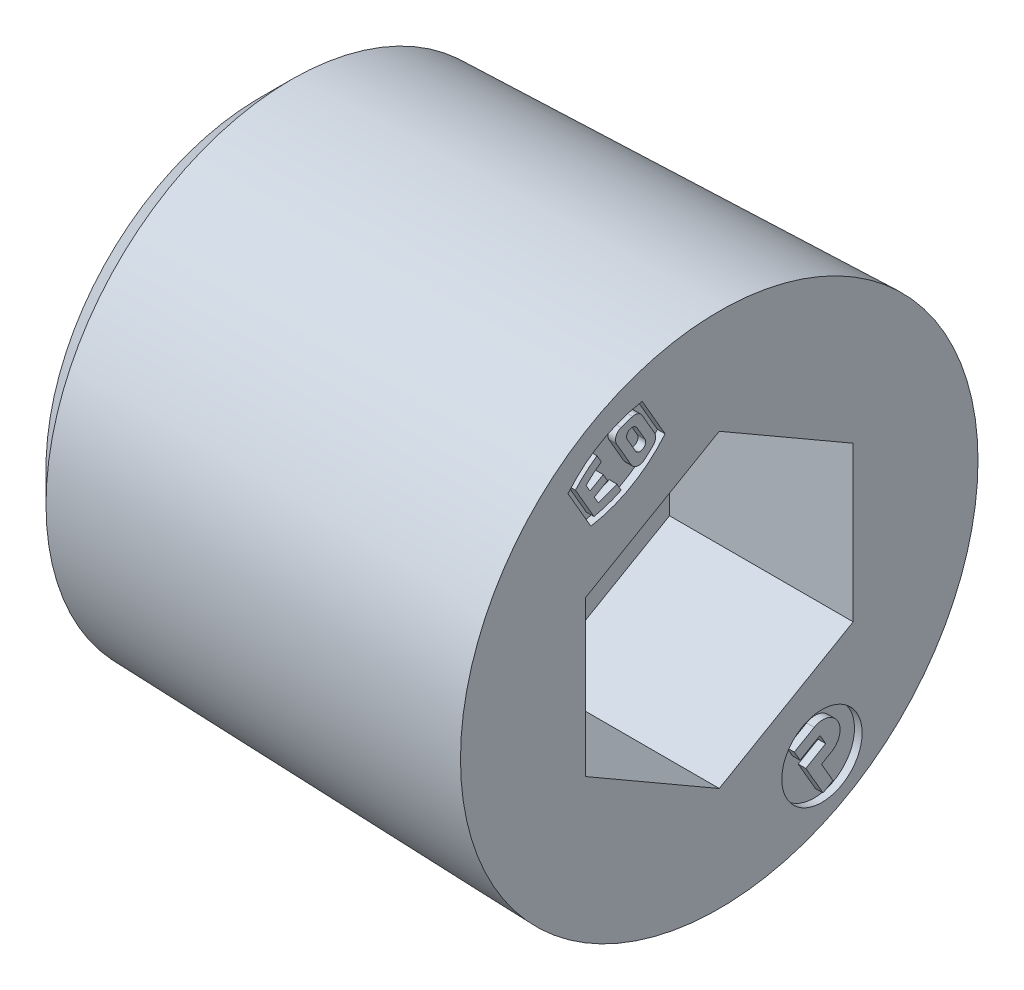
ISO-10303-21;
HEADER;
FILE_DESCRIPTION(('STEP AP214'),'2;1');
FILE_NAME('part.step','',(''),(''),'','','');
FILE_SCHEMA(('AUTOMOTIVE_DESIGN { 1 0 10303 214 1 1 1 1 }'));
ENDSEC;
DATA;
#1=APPLICATION_CONTEXT('core data for automotive mechanical design processes');
#2=APPLICATION_PROTOCOL_DEFINITION('international standard','automotive_design',2000,#1);
#3=PRODUCT_CONTEXT('',#1,'mechanical');
#4=PRODUCT('Part','Part','',(#3));
#5=PRODUCT_RELATED_PRODUCT_CATEGORY('part','',(#4));
#6=PRODUCT_DEFINITION_FORMATION('','',#4);
#7=PRODUCT_DEFINITION_CONTEXT('part definition',#1,'design');
#8=PRODUCT_DEFINITION('design','',#6,#7);
#9=PRODUCT_DEFINITION_SHAPE('','',#8);
#10=(LENGTH_UNIT() NAMED_UNIT(*) SI_UNIT(.MILLI.,.METRE.));
#11=(NAMED_UNIT(*) PLANE_ANGLE_UNIT() SI_UNIT($,.RADIAN.));
#12=(NAMED_UNIT(*) SI_UNIT($,.STERADIAN.) SOLID_ANGLE_UNIT());
#13=UNCERTAINTY_MEASURE_WITH_UNIT(LENGTH_MEASURE(1.E-05),#10,'distance_accuracy_value','');
#14=(GEOMETRIC_REPRESENTATION_CONTEXT(3) GLOBAL_UNCERTAINTY_ASSIGNED_CONTEXT((#13)) GLOBAL_UNIT_ASSIGNED_CONTEXT((#10,
#11,#12)) REPRESENTATION_CONTEXT('',''));
#15=CARTESIAN_POINT('',(0.,0.,0.));
#16=DIRECTION('',(0.,0.,1.));
#17=DIRECTION('',(1.,0.,0.));
#18=AXIS2_PLACEMENT_3D('',#15,#16,#17);
#19=CARTESIAN_POINT('',(0.,-4.28863365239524,-2.706983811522));
#20=DIRECTION('',(1.,0.,0.));
#21=DIRECTION('',(0.,1.,0.));
#22=AXIS2_PLACEMENT_3D('',#19,#20,#21);
#23=PLANE('',#22);
#24=DIRECTION('',(0.,-0.499999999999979,0.866025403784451));
#25=VECTOR('',#24,1.);
#26=CARTESIAN_POINT('',(0.,-3.89892218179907,-2.48198387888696));
#27=LINE('',#26,#25);
#28=CARTESIAN_POINT('',(0.,-3.89892218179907,-2.48198387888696));
#29=VERTEX_POINT('',#28);
#30=CARTESIAN_POINT('',(0.,-4.19892218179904,-1.96236863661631));
#31=VERTEX_POINT('',#30);
#32=EDGE_CURVE('E789',#29,#31,#27,.T.);
#33=ORIENTED_EDGE('',*,*,#32,.T.);
#34=DIRECTION('',(0.,-0.866025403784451,-0.499999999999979));
#35=VECTOR('',#34,1.);
#36=CARTESIAN_POINT('',(0.,-4.19892218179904,-1.96236863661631));
#37=LINE('',#36,#35);
#38=CARTESIAN_POINT('',(0.,-4.45872980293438,-2.1123686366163));
#39=VERTEX_POINT('',#38);
#40=EDGE_CURVE('E494',#31,#39,#37,.T.);
#41=ORIENTED_EDGE('',*,*,#40,.T.);
#42=DIRECTION('',(0.,0.499999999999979,-0.866025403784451));
#43=VECTOR('',#42,1.);
#44=CARTESIAN_POINT('',(0.,-4.45872980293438,-2.1123686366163));
#45=LINE('',#44,#43);
#46=CARTESIAN_POINT('',(0.,-4.1587298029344,-2.63198387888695));
#47=VERTEX_POINT('',#46);
#48=EDGE_CURVE('E493',#39,#47,#45,.T.);
#49=ORIENTED_EDGE('',*,*,#48,.T.);
#50=DIRECTION('',(0.,-0.866025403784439,-0.5));
#51=VECTOR('',#50,1.);
#52=CARTESIAN_POINT('',(0.,-4.1587298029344,-2.63198387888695));
#53=LINE('',#52,#51);
#54=CARTESIAN_POINT('',(0.,-4.41853742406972,-2.78198387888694));
#55=VERTEX_POINT('',#54);
#56=EDGE_CURVE('E798',#47,#55,#53,.T.);
#57=ORIENTED_EDGE('',*,*,#56,.T.);
#58=DIRECTION('',(0.,-0.5,0.866025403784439));
#59=VECTOR('',#58,1.);
#60=CARTESIAN_POINT('',(0.,-4.41853742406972,-2.78198387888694));
#61=LINE('',#60,#59);
#62=CARTESIAN_POINT('',(0.,-4.71853742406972,-2.26236863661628));
#63=VERTEX_POINT('',#62);
#64=EDGE_CURVE('E501',#55,#63,#61,.T.);
#65=ORIENTED_EDGE('',*,*,#64,.T.);
#66=DIRECTION('',(0.,-0.866025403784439,-0.5));
#67=VECTOR('',#66,1.);
#68=CARTESIAN_POINT('',(0.,-4.71853742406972,-2.26236863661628));
#69=LINE('',#68,#67);
#70=CARTESIAN_POINT('',(0.,-5.49796028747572,-2.71236863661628));
#71=VERTEX_POINT('',#70);
#72=EDGE_CURVE('E643',#63,#71,#69,.T.);
#73=ORIENTED_EDGE('',*,*,#72,.T.);
#74=DIRECTION('',(0.,0.499999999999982,-0.866025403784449));
#75=VECTOR('',#74,1.);
#76=CARTESIAN_POINT('',(0.,-5.49796028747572,-2.71236863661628));
#77=LINE('',#76,#75);
#78=CARTESIAN_POINT('',(0.,-5.34796028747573,-2.97217625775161));
#79=VERTEX_POINT('',#78);
#80=EDGE_CURVE('E642',#71,#79,#77,.T.);
#81=ORIENTED_EDGE('',*,*,#80,.T.);
#82=DIRECTION('',(0.,0.866025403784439,0.5));
#83=VECTOR('',#82,1.);
#84=CARTESIAN_POINT('',(0.,-5.34796028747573,-2.97217625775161));
#85=LINE('',#84,#83);
#86=CARTESIAN_POINT('',(0.,-4.82834504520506,-2.67217625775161));
#87=VERTEX_POINT('',#86);
#88=EDGE_CURVE('E518',#79,#87,#85,.T.);
#89=ORIENTED_EDGE('',*,*,#88,.T.);
#90=DIRECTION('',(0.,0.5,-0.866025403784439));
#91=VECTOR('',#90,1.);
#92=CARTESIAN_POINT('',(0.,-4.82834504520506,-2.67217625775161));
#93=LINE('',#92,#91);
#94=CARTESIAN_POINT('',(0.,-4.67834504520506,-2.93198387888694));
#95=VERTEX_POINT('',#94);
#96=EDGE_CURVE('E517',#87,#95,#93,.T.);
#97=ORIENTED_EDGE('',*,*,#96,.T.);
#98=CARTESIAN_POINT('',(0.,-4.28863365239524,-2.706983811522));
#99=DIRECTION('',(1.,0.,0.));
#100=DIRECTION('',(0.,0.,-1.));
#101=AXIS2_PLACEMENT_3D('',#98,#99,#100);
#102=CIRCLE('',#101,0.45);
#103=EDGE_CURVE('E11',#95,#29,#102,.T.);
#104=ORIENTED_EDGE('',*,*,#103,.T.);
#105=EDGE_LOOP('',(#33,#41,#49,#57,#65,#73,#81,#89,#97,#104));
#106=FACE_BOUND('',#105,.T.);
#107=ADVANCED_FACE('F16',(#106),#23,.T.);
#108=CARTESIAN_POINT('',(-0.2,-4.28863365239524,-2.706983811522));
#109=DIRECTION('',(-1.,0.,0.));
#110=DIRECTION('',(0.,0.,-1.));
#111=AXIS2_PLACEMENT_3D('',#108,#109,#110);
#112=CYLINDRICAL_SURFACE('',#111,0.45);
#113=ORIENTED_EDGE('',*,*,#103,.F.);
#114=DIRECTION('',(1.,0.,0.));
#115=VECTOR('',#114,1.);
#116=CARTESIAN_POINT('',(-0.2,-4.67834504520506,-2.93198387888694));
#117=LINE('',#116,#115);
#118=CARTESIAN_POINT('',(-0.2,-4.67834504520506,-2.93198387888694));
#119=VERTEX_POINT('',#118);
#120=EDGE_CURVE('E27',#119,#95,#117,.T.);
#121=ORIENTED_EDGE('',*,*,#120,.F.);
#122=CARTESIAN_POINT('',(-0.2,-4.28863365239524,-2.706983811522));
#123=DIRECTION('',(1.,0.,0.));
#124=DIRECTION('',(0.,0.,-1.));
#125=AXIS2_PLACEMENT_3D('',#122,#123,#124);
#126=CIRCLE('',#125,0.45);
#127=CARTESIAN_POINT('',(-0.2,-3.89892218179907,-2.48198387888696));
#128=VERTEX_POINT('',#127);
#129=EDGE_CURVE('E573',#119,#128,#126,.T.);
#130=ORIENTED_EDGE('',*,*,#129,.T.);
#131=DIRECTION('',(1.,0.,0.));
#132=VECTOR('',#131,1.);
#133=CARTESIAN_POINT('',(-0.2,-3.89892218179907,-2.48198387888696));
#134=LINE('',#133,#132);
#135=EDGE_CURVE('E793',#128,#29,#134,.T.);
#136=ORIENTED_EDGE('',*,*,#135,.T.);
#137=EDGE_LOOP('',(#113,#121,#130,#136));
#138=FACE_BOUND('',#137,.T.);
#139=ADVANCED_FACE('F1009',(#138),#112,.T.);
#140=CARTESIAN_POINT('',(-0.2,-4.82834504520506,-2.67217625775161));
#141=DIRECTION('',(0.,-0.866025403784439,-0.5));
#142=DIRECTION('',(0.,0.5,-0.866025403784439));
#143=AXIS2_PLACEMENT_3D('',#140,#141,#142);
#144=PLANE('',#143);
#145=ORIENTED_EDGE('',*,*,#96,.F.);
#146=DIRECTION('',(1.,0.,0.));
#147=VECTOR('',#146,1.);
#148=CARTESIAN_POINT('',(-0.2,-4.82834504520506,-2.67217625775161));
#149=LINE('',#148,#147);
#150=CARTESIAN_POINT('',(-0.2,-4.82834504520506,-2.67217625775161));
#151=VERTEX_POINT('',#150);
#152=EDGE_CURVE('E513',#151,#87,#149,.T.);
#153=ORIENTED_EDGE('',*,*,#152,.F.);
#154=DIRECTION('',(0.,0.5,-0.866025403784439));
#155=VECTOR('',#154,1.);
#156=CARTESIAN_POINT('',(-0.2,-4.82834504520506,-2.67217625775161));
#157=LINE('',#156,#155);
#158=EDGE_CURVE('E568',#151,#119,#157,.T.);
#159=ORIENTED_EDGE('',*,*,#158,.T.);
#160=ORIENTED_EDGE('',*,*,#120,.T.);
#161=EDGE_LOOP('',(#145,#153,#159,#160));
#162=FACE_BOUND('',#161,.T.);
#163=ADVANCED_FACE('F994',(#162),#144,.T.);
#164=CARTESIAN_POINT('',(-0.2,-5.34796028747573,-2.97217625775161));
#165=DIRECTION('',(0.,0.5,-0.866025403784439));
#166=DIRECTION('',(-1.,0.,0.));
#167=AXIS2_PLACEMENT_3D('',#164,#165,#166);
#168=PLANE('',#167);
#169=ORIENTED_EDGE('',*,*,#88,.F.);
#170=DIRECTION('',(1.,0.,0.));
#171=VECTOR('',#170,1.);
#172=CARTESIAN_POINT('',(-0.2,-5.34796028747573,-2.97217625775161));
#173=LINE('',#172,#171);
#174=CARTESIAN_POINT('',(-0.2,-5.34796028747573,-2.97217625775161));
#175=VERTEX_POINT('',#174);
#176=EDGE_CURVE('E651',#175,#79,#173,.T.);
#177=ORIENTED_EDGE('',*,*,#176,.F.);
#178=DIRECTION('',(0.,0.866025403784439,0.5));
#179=VECTOR('',#178,1.);
#180=CARTESIAN_POINT('',(-0.2,-5.34796028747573,-2.97217625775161));
#181=LINE('',#180,#179);
#182=EDGE_CURVE('E572',#175,#151,#181,.T.);
#183=ORIENTED_EDGE('',*,*,#182,.T.);
#184=ORIENTED_EDGE('',*,*,#152,.T.);
#185=EDGE_LOOP('',(#169,#177,#183,#184));
#186=FACE_BOUND('',#185,.T.);
#187=ADVANCED_FACE('F998',(#186),#168,.T.);
#188=CARTESIAN_POINT('',(-0.2,-5.49796028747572,-2.71236863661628));
#189=DIRECTION('',(0.,-0.866025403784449,-0.499999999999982));
#190=DIRECTION('',(0.,0.499999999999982,-0.866025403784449));
#191=AXIS2_PLACEMENT_3D('',#188,#189,#190);
#192=PLANE('',#191);
#193=ORIENTED_EDGE('',*,*,#80,.F.);
#194=DIRECTION('',(1.,0.,0.));
#195=VECTOR('',#194,1.);
#196=CARTESIAN_POINT('',(-0.2,-5.49796028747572,-2.71236863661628));
#197=LINE('',#196,#195);
#198=CARTESIAN_POINT('',(-0.2,-5.49796028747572,-2.71236863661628));
#199=VERTEX_POINT('',#198);
#200=EDGE_CURVE('E639',#199,#71,#197,.T.);
#201=ORIENTED_EDGE('',*,*,#200,.F.);
#202=DIRECTION('',(0.,0.499999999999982,-0.866025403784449));
#203=VECTOR('',#202,1.);
#204=CARTESIAN_POINT('',(-0.2,-5.49796028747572,-2.71236863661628));
#205=LINE('',#204,#203);
#206=EDGE_CURVE('E632',#199,#175,#205,.T.);
#207=ORIENTED_EDGE('',*,*,#206,.T.);
#208=ORIENTED_EDGE('',*,*,#176,.T.);
#209=EDGE_LOOP('',(#193,#201,#207,#208));
#210=FACE_BOUND('',#209,.T.);
#211=ADVANCED_FACE('F1000',(#210),#192,.T.);
#212=CARTESIAN_POINT('',(-0.2,-4.71853742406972,-2.26236863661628));
#213=DIRECTION('',(0.,-0.5,0.866025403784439));
#214=DIRECTION('',(-1.,0.,0.));
#215=AXIS2_PLACEMENT_3D('',#212,#213,#214);
#216=PLANE('',#215);
#217=ORIENTED_EDGE('',*,*,#72,.F.);
#218=DIRECTION('',(1.,0.,0.));
#219=VECTOR('',#218,1.);
#220=CARTESIAN_POINT('',(-0.2,-4.71853742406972,-2.26236863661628));
#221=LINE('',#220,#219);
#222=CARTESIAN_POINT('',(-0.2,-4.71853742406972,-2.26236863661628));
#223=VERTEX_POINT('',#222);
#224=EDGE_CURVE('E505',#223,#63,#221,.T.);
#225=ORIENTED_EDGE('',*,*,#224,.F.);
#226=DIRECTION('',(0.,-0.866025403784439,-0.5));
#227=VECTOR('',#226,1.);
#228=CARTESIAN_POINT('',(-0.2,-4.71853742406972,-2.26236863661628));
#229=LINE('',#228,#227);
#230=EDGE_CURVE('E598',#223,#199,#229,.T.);
#231=ORIENTED_EDGE('',*,*,#230,.T.);
#232=ORIENTED_EDGE('',*,*,#200,.T.);
#233=EDGE_LOOP('',(#217,#225,#231,#232));
#234=FACE_BOUND('',#233,.T.);
#235=ADVANCED_FACE('F1023',(#234),#216,.T.);
#236=CARTESIAN_POINT('',(-0.2,-4.41853742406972,-2.78198387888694));
#237=DIRECTION('',(0.,0.866025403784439,0.5));
#238=DIRECTION('',(1.,0.,0.));
#239=AXIS2_PLACEMENT_3D('',#236,#237,#238);
#240=PLANE('',#239);
#241=ORIENTED_EDGE('',*,*,#64,.F.);
#242=DIRECTION('',(1.,0.,0.));
#243=VECTOR('',#242,1.);
#244=CARTESIAN_POINT('',(-0.2,-4.41853742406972,-2.78198387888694));
#245=LINE('',#244,#243);
#246=CARTESIAN_POINT('',(-0.2,-4.41853742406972,-2.78198387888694));
#247=VERTEX_POINT('',#246);
#248=EDGE_CURVE('E506',#247,#55,#245,.T.);
#249=ORIENTED_EDGE('',*,*,#248,.F.);
#250=DIRECTION('',(0.,-0.5,0.866025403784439));
#251=VECTOR('',#250,1.);
#252=CARTESIAN_POINT('',(-0.2,-4.41853742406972,-2.78198387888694));
#253=LINE('',#252,#251);
#254=EDGE_CURVE('E593',#247,#223,#253,.T.);
#255=ORIENTED_EDGE('',*,*,#254,.T.);
#256=ORIENTED_EDGE('',*,*,#224,.T.);
#257=EDGE_LOOP('',(#241,#249,#255,#256));
#258=FACE_BOUND('',#257,.T.);
#259=ADVANCED_FACE('F1022',(#258),#240,.T.);
#260=CARTESIAN_POINT('',(-0.2,-4.1587298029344,-2.63198387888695));
#261=DIRECTION('',(0.,-0.5,0.866025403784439));
#262=DIRECTION('',(-1.,0.,0.));
#263=AXIS2_PLACEMENT_3D('',#260,#261,#262);
#264=PLANE('',#263);
#265=ORIENTED_EDGE('',*,*,#56,.F.);
#266=DIRECTION('',(1.,0.,0.));
#267=VECTOR('',#266,1.);
#268=CARTESIAN_POINT('',(-0.2,-4.1587298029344,-2.63198387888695));
#269=LINE('',#268,#267);
#270=CARTESIAN_POINT('',(-0.2,-4.1587298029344,-2.63198387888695));
#271=VERTEX_POINT('',#270);
#272=EDGE_CURVE('E522',#271,#47,#269,.T.);
#273=ORIENTED_EDGE('',*,*,#272,.F.);
#274=DIRECTION('',(0.,-0.866025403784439,-0.5));
#275=VECTOR('',#274,1.);
#276=CARTESIAN_POINT('',(-0.2,-4.1587298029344,-2.63198387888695));
#277=LINE('',#276,#275);
#278=EDGE_CURVE('E597',#271,#247,#277,.T.);
#279=ORIENTED_EDGE('',*,*,#278,.T.);
#280=ORIENTED_EDGE('',*,*,#248,.T.);
#281=EDGE_LOOP('',(#265,#273,#279,#280));
#282=FACE_BOUND('',#281,.T.);
#283=ADVANCED_FACE('F1020',(#282),#264,.T.);
#284=CARTESIAN_POINT('',(-0.2,-4.45872980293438,-2.1123686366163));
#285=DIRECTION('',(0.,-0.866025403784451,-0.499999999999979));
#286=DIRECTION('',(0.,0.499999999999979,-0.866025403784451));
#287=AXIS2_PLACEMENT_3D('',#284,#285,#286);
#288=PLANE('',#287);
#289=ORIENTED_EDGE('',*,*,#48,.F.);
#290=DIRECTION('',(1.,0.,0.));
#291=VECTOR('',#290,1.);
#292=CARTESIAN_POINT('',(-0.2,-4.45872980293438,-2.1123686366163));
#293=LINE('',#292,#291);
#294=CARTESIAN_POINT('',(-0.2,-4.45872980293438,-2.1123686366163));
#295=VERTEX_POINT('',#294);
#296=EDGE_CURVE('E489',#295,#39,#293,.T.);
#297=ORIENTED_EDGE('',*,*,#296,.F.);
#298=DIRECTION('',(0.,0.499999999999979,-0.866025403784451));
#299=VECTOR('',#298,1.);
#300=CARTESIAN_POINT('',(-0.2,-4.45872980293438,-2.1123686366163));
#301=LINE('',#300,#299);
#302=EDGE_CURVE('E836',#295,#271,#301,.T.);
#303=ORIENTED_EDGE('',*,*,#302,.T.);
#304=ORIENTED_EDGE('',*,*,#272,.T.);
#305=EDGE_LOOP('',(#289,#297,#303,#304));
#306=FACE_BOUND('',#305,.T.);
#307=ADVANCED_FACE('F1016',(#306),#288,.T.);
#308=CARTESIAN_POINT('',(-0.2,-4.19892218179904,-1.96236863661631));
#309=DIRECTION('',(0.,-0.499999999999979,0.866025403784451));
#310=DIRECTION('',(-1.,0.,0.));
#311=AXIS2_PLACEMENT_3D('',#308,#309,#310);
#312=PLANE('',#311);
#313=ORIENTED_EDGE('',*,*,#40,.F.);
#314=DIRECTION('',(1.,0.,0.));
#315=VECTOR('',#314,1.);
#316=CARTESIAN_POINT('',(-0.2,-4.19892218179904,-1.96236863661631));
#317=LINE('',#316,#315);
#318=CARTESIAN_POINT('',(-0.2,-4.19892218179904,-1.96236863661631));
#319=VERTEX_POINT('',#318);
#320=EDGE_CURVE('E821',#319,#31,#317,.T.);
#321=ORIENTED_EDGE('',*,*,#320,.F.);
#322=DIRECTION('',(0.,-0.866025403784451,-0.499999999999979));
#323=VECTOR('',#322,1.);
#324=CARTESIAN_POINT('',(-0.2,-4.19892218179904,-1.96236863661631));
#325=LINE('',#324,#323);
#326=EDGE_CURVE('E794',#319,#295,#325,.T.);
#327=ORIENTED_EDGE('',*,*,#326,.T.);
#328=ORIENTED_EDGE('',*,*,#296,.T.);
#329=EDGE_LOOP('',(#313,#321,#327,#328));
#330=FACE_BOUND('',#329,.T.);
#331=ADVANCED_FACE('F1014',(#330),#312,.T.);
#332=CARTESIAN_POINT('',(-0.2,-3.89892218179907,-2.48198387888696));
#333=DIRECTION('',(0.,0.866025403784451,0.499999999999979));
#334=DIRECTION('',(1.,0.,0.));
#335=AXIS2_PLACEMENT_3D('',#332,#333,#334);
#336=PLANE('',#335);
#337=ORIENTED_EDGE('',*,*,#32,.F.);
#338=ORIENTED_EDGE('',*,*,#135,.F.);
#339=DIRECTION('',(0.,-0.499999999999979,0.866025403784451));
#340=VECTOR('',#339,1.);
#341=CARTESIAN_POINT('',(-0.2,-3.89892218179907,-2.48198387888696));
#342=LINE('',#341,#340);
#343=EDGE_CURVE('E713',#128,#319,#342,.T.);
#344=ORIENTED_EDGE('',*,*,#343,.T.);
#345=ORIENTED_EDGE('',*,*,#320,.T.);
#346=EDGE_LOOP('',(#337,#338,#344,#345));
#347=FACE_BOUND('',#346,.T.);
#348=ADVANCED_FACE('F1012',(#347),#336,.T.);
#349=CARTESIAN_POINT('',(-0.2,-4.64844123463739,-2.68377879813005));
#350=DIRECTION('',(1.,0.,0.));
#351=DIRECTION('',(0.,1.,0.));
#352=AXIS2_PLACEMENT_3D('',#349,#350,#351);
#353=PLANE('',#352);
#354=ORIENTED_EDGE('',*,*,#343,.F.);
#355=ORIENTED_EDGE('',*,*,#129,.F.);
#356=ORIENTED_EDGE('',*,*,#158,.F.);
#357=ORIENTED_EDGE('',*,*,#182,.F.);
#358=ORIENTED_EDGE('',*,*,#206,.F.);
#359=ORIENTED_EDGE('',*,*,#230,.F.);
#360=ORIENTED_EDGE('',*,*,#254,.F.);
#361=ORIENTED_EDGE('',*,*,#278,.F.);
#362=ORIENTED_EDGE('',*,*,#302,.F.);
#363=ORIENTED_EDGE('',*,*,#326,.F.);
#364=EDGE_LOOP('',(#354,#355,#356,#357,#358,#359,#360,#361,#362,#363));
#365=FACE_BOUND('',#364,.T.);
#366=CARTESIAN_POINT('',(-0.2,-4.64844123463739,-2.68377879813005));
#367=DIRECTION('',(1.,0.,0.));
#368=DIRECTION('',(0.,0.,-1.));
#369=AXIS2_PLACEMENT_3D('',#366,#367,#368);
#370=CIRCLE('',#369,1.05);
#371=CARTESIAN_POINT('',(-0.2,-4.64844123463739,-3.73377879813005));
#372=VERTEX_POINT('',#371);
#373=EDGE_CURVE('E592',#372,#372,#370,.T.);
#374=ORIENTED_EDGE('',*,*,#373,.T.);
#375=EDGE_LOOP('',(#374));
#376=FACE_BOUND('',#375,.T.);
#377=ADVANCED_FACE('F1006',(#365,#376),#353,.T.);
#378=CARTESIAN_POINT('',(-0.2,-4.64844123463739,-2.68377879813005));
#379=DIRECTION('',(-1.,0.,0.));
#380=DIRECTION('',(0.,0.,-1.));
#381=AXIS2_PLACEMENT_3D('',#378,#379,#380);
#382=CYLINDRICAL_SURFACE('',#381,1.05);
#383=ORIENTED_EDGE('',*,*,#373,.F.);
#384=EDGE_LOOP('',(#383));
#385=FACE_BOUND('',#384,.T.);
#386=CARTESIAN_POINT('',(0.,-4.64844123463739,-2.68377879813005));
#387=DIRECTION('',(1.,0.,0.));
#388=DIRECTION('',(0.,0.,-1.));
#389=AXIS2_PLACEMENT_3D('',#386,#387,#388);
#390=CIRCLE('',#389,1.05);
#391=CARTESIAN_POINT('',(0.,-4.64844123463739,-3.73377879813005));
#392=VERTEX_POINT('',#391);
#393=EDGE_CURVE('E680',#392,#392,#390,.T.);
#394=ORIENTED_EDGE('',*,*,#393,.T.);
#395=EDGE_LOOP('',(#394));
#396=FACE_BOUND('',#395,.T.);
#397=ADVANCED_FACE('F1057',(#385,#396),#382,.F.);
#398=CARTESIAN_POINT('',(-0.2,2.56998026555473,1.48377879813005));
#399=DIRECTION('',(1.,0.,0.));
#400=DIRECTION('',(0.,1.,0.));
#401=AXIS2_PLACEMENT_3D('',#398,#399,#400);
#402=PLANE('',#401);
#403=CARTESIAN_POINT('',(-0.2,4.76430795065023,2.06709175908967));
#404=DIRECTION('',(1.,0.,0.));
#405=DIRECTION('',(0.,0.,-1.));
#406=AXIS2_PLACEMENT_3D('',#403,#404,#405);
#407=CIRCLE('',#406,0.144);
#408=CARTESIAN_POINT('',(-0.2,4.69230795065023,2.19179941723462));
#409=VERTEX_POINT('',#408);
#410=CARTESIAN_POINT('',(-0.2,4.83630795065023,1.94238410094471));
#411=VERTEX_POINT('',#410);
#412=EDGE_CURVE('E827',#409,#411,#407,.T.);
#413=ORIENTED_EDGE('',*,*,#412,.T.);
#414=DIRECTION('',(0.,0.866025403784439,0.5));
#415=VECTOR('',#414,1.);
#416=CARTESIAN_POINT('',(-0.2,4.83630795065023,1.94238410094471));
#417=LINE('',#416,#415);
#418=CARTESIAN_POINT('',(-0.2,5.19657451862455,2.15038410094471));
#419=VERTEX_POINT('',#418);
#420=EDGE_CURVE('E556',#411,#419,#417,.T.);
#421=ORIENTED_EDGE('',*,*,#420,.T.);
#422=CARTESIAN_POINT('',(-0.2,5.12457451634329,2.27509175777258));
#423=DIRECTION('',(1.,0.,0.));
#424=DIRECTION('',(0.,0.,-1.));
#425=AXIS2_PLACEMENT_3D('',#422,#423,#424);
#426=CIRCLE('',#425,0.144);
#427=CARTESIAN_POINT('',(-0.2,5.05257451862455,2.39979941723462));
#428=VERTEX_POINT('',#427);
#429=EDGE_CURVE('E484',#419,#428,#426,.T.);
#430=ORIENTED_EDGE('',*,*,#429,.T.);
#431=DIRECTION('',(0.,-0.866025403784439,-0.5));
#432=VECTOR('',#431,1.);
#433=CARTESIAN_POINT('',(-0.2,5.05257451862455,2.39979941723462));
#434=LINE('',#433,#432);
#435=EDGE_CURVE('E613',#428,#409,#434,.T.);
#436=ORIENTED_EDGE('',*,*,#435,.T.);
#437=EDGE_LOOP('',(#413,#421,#430,#436));
#438=FACE_BOUND('',#437,.T.);
#439=ADVANCED_FACE('F1054',(#438),#402,.T.);
#440=CARTESIAN_POINT('',(0.,2.56998026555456,1.48377879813));
#441=DIRECTION('',(1.,0.,0.));
#442=DIRECTION('',(0.,1.,0.));
#443=AXIS2_PLACEMENT_3D('',#440,#441,#442);
#444=PLANE('',#443);
#445=DIRECTION('',(0.,0.866025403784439,0.5));
#446=VECTOR('',#445,1.);
#447=CARTESIAN_POINT('',(0.,4.83630795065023,1.94238410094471));
#448=LINE('',#447,#446);
#449=CARTESIAN_POINT('',(0.,4.83630795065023,1.94238410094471));
#450=VERTEX_POINT('',#449);
#451=CARTESIAN_POINT('',(0.,5.19657451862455,2.15038410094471));
#452=VERTEX_POINT('',#451);
#453=EDGE_CURVE('E473',#450,#452,#448,.T.);
#454=ORIENTED_EDGE('',*,*,#453,.F.);
#455=CARTESIAN_POINT('',(0.,4.76430795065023,2.06709175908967));
#456=DIRECTION('',(1.,0.,0.));
#457=DIRECTION('',(0.,0.,-1.));
#458=AXIS2_PLACEMENT_3D('',#455,#456,#457);
#459=CIRCLE('',#458,0.144);
#460=CARTESIAN_POINT('',(0.,4.69230795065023,2.19179941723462));
#461=VERTEX_POINT('',#460);
#462=EDGE_CURVE('E832',#461,#450,#459,.T.);
#463=ORIENTED_EDGE('',*,*,#462,.F.);
#464=DIRECTION('',(0.,-0.866025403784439,-0.5));
#465=VECTOR('',#464,1.);
#466=CARTESIAN_POINT('',(0.,5.05257451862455,2.39979941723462));
#467=LINE('',#466,#465);
#468=CARTESIAN_POINT('',(0.,5.05257451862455,2.39979941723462));
#469=VERTEX_POINT('',#468);
#470=EDGE_CURVE('E684',#469,#461,#467,.T.);
#471=ORIENTED_EDGE('',*,*,#470,.F.);
#472=CARTESIAN_POINT('',(0.,5.12457451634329,2.27509175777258));
#473=DIRECTION('',(1.,0.,0.));
#474=DIRECTION('',(0.,0.,-1.));
#475=AXIS2_PLACEMENT_3D('',#472,#473,#474);
#476=CIRCLE('',#475,0.144);
#477=EDGE_CURVE('E488',#452,#469,#476,.T.);
#478=ORIENTED_EDGE('',*,*,#477,.F.);
#479=EDGE_LOOP('',(#454,#463,#471,#478));
#480=FACE_BOUND('',#479,.T.);
#481=CARTESIAN_POINT('',(0.,2.56998026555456,1.48377879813));
#482=DIRECTION('',(1.,0.,0.));
#483=DIRECTION('',(0.,0.,-1.));
#484=AXIS2_PLACEMENT_3D('',#481,#482,#483);
#485=CIRCLE('',#484,3.04);
#486=CARTESIAN_POINT('',(0.,5.50845804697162,2.26284768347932));
#487=VERTEX_POINT('',#486);
#488=CARTESIAN_POINT('',(0.,5.41098522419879,2.56557860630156));
#489=VERTEX_POINT('',#488);
#490=EDGE_CURVE('E463',#487,#489,#485,.T.);
#491=ORIENTED_EDGE('',*,*,#490,.T.);
#492=CARTESIAN_POINT('',(0.,5.20164801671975,2.48586704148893));
#493=DIRECTION('',(1.,0.,0.));
#494=DIRECTION('',(0.,0.,-1.));
#495=AXIS2_PLACEMENT_3D('',#492,#493,#494);
#496=CIRCLE('',#495,0.224);
#497=CARTESIAN_POINT('',(0.,5.08964801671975,2.67985673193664));
#498=VERTEX_POINT('',#497);
#499=EDGE_CURVE('E879',#489,#498,#496,.T.);
#500=ORIENTED_EDGE('',*,*,#499,.T.);
#501=DIRECTION('',(0.,-0.866025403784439,-0.5));
#502=VECTOR('',#501,1.);
#503=CARTESIAN_POINT('',(0.,5.08964801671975,2.67985673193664));
#504=LINE('',#503,#502);
#505=CARTESIAN_POINT('',(0.,4.43123445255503,2.29972148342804));
#506=VERTEX_POINT('',#505);
#507=EDGE_CURVE('E698',#498,#506,#504,.T.);
#508=ORIENTED_EDGE('',*,*,#507,.T.);
#509=CARTESIAN_POINT('',(0.,4.54323445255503,2.10573179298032));
#510=DIRECTION('',(1.,0.,0.));
#511=DIRECTION('',(0.,0.,-1.));
#512=AXIS2_PLACEMENT_3D('',#509,#510,#511);
#513=CIRCLE('',#512,0.224);
#514=CARTESIAN_POINT('',(0.,4.36953360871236,1.9642962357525));
#515=VERTEX_POINT('',#514);
#516=EDGE_CURVE('E697',#506,#515,#513,.T.);
#517=ORIENTED_EDGE('',*,*,#516,.T.);
#518=CARTESIAN_POINT('',(0.,6.72690220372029,3.88377879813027));
#519=DIRECTION('',(1.,0.,0.));
#520=DIRECTION('',(0.,0.,-1.));
#521=AXIS2_PLACEMENT_3D('',#518,#519,#520);
#522=CIRCLE('',#521,3.04);
#523=CARTESIAN_POINT('',(0.,4.58296984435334,1.72851685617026));
#524=VERTEX_POINT('',#523);
#525=EDGE_CURVE('E589',#515,#524,#522,.T.);
#526=ORIENTED_EDGE('',*,*,#525,.T.);
#527=CARTESIAN_POINT('',(0.,4.74094383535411,1.88732560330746));
#528=DIRECTION('',(1.,0.,0.));
#529=DIRECTION('',(0.,0.,-1.));
#530=AXIS2_PLACEMENT_3D('',#527,#528,#529);
#531=CIRCLE('',#530,0.224);
#532=CARTESIAN_POINT('',(0.,4.85294383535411,1.69333591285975));
#533=VERTEX_POINT('',#532);
#534=EDGE_CURVE('E588',#524,#533,#531,.T.);
#535=ORIENTED_EDGE('',*,*,#534,.T.);
#536=DIRECTION('',(0.,0.866025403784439,0.5));
#537=VECTOR('',#536,1.);
#538=CARTESIAN_POINT('',(0.,4.85294383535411,1.69333591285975));
#539=LINE('',#538,#537);
#540=CARTESIAN_POINT('',(0.,5.40393863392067,2.01145290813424));
#541=VERTEX_POINT('',#540);
#542=EDGE_CURVE('E467',#533,#541,#539,.T.);
#543=ORIENTED_EDGE('',*,*,#542,.T.);
#544=CARTESIAN_POINT('',(0.,5.29193863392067,2.20544259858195));
#545=DIRECTION('',(1.,0.,0.));
#546=DIRECTION('',(0.,0.,-1.));
#547=AXIS2_PLACEMENT_3D('',#544,#545,#546);
#548=CIRCLE('',#547,0.224);
#549=EDGE_CURVE('E487',#541,#487,#548,.T.);
#550=ORIENTED_EDGE('',*,*,#549,.T.);
#551=EDGE_LOOP('',(#491,#500,#508,#517,#526,#535,#543,#550));
#552=FACE_BOUND('',#551,.T.);
#553=ADVANCED_FACE('F1047',(#480,#552),#444,.T.);
#554=CARTESIAN_POINT('',(-0.2,5.29193863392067,2.20544259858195));
#555=DIRECTION('',(-1.,0.,0.));
#556=DIRECTION('',(0.,0.,-1.));
#557=AXIS2_PLACEMENT_3D('',#554,#555,#556);
#558=CYLINDRICAL_SURFACE('',#557,0.224);
#559=ORIENTED_EDGE('',*,*,#549,.F.);
#560=DIRECTION('',(1.,0.,0.));
#561=VECTOR('',#560,1.);
#562=CARTESIAN_POINT('',(-0.2,5.40393863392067,2.01145290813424));
#563=LINE('',#562,#561);
#564=CARTESIAN_POINT('',(-0.2,5.40393863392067,2.01145290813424));
#565=VERTEX_POINT('',#564);
#566=EDGE_CURVE('E471',#565,#541,#563,.T.);
#567=ORIENTED_EDGE('',*,*,#566,.F.);
#568=CARTESIAN_POINT('',(-0.2,5.29193863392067,2.20544259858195));
#569=DIRECTION('',(1.,0.,0.));
#570=DIRECTION('',(0.,0.,-1.));
#571=AXIS2_PLACEMENT_3D('',#568,#569,#570);
#572=CIRCLE('',#571,0.224);
#573=CARTESIAN_POINT('',(-0.2,5.50845804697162,2.26284768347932));
#574=VERTEX_POINT('',#573);
#575=EDGE_CURVE('E577',#565,#574,#572,.T.);
#576=ORIENTED_EDGE('',*,*,#575,.T.);
#577=DIRECTION('',(1.,0.,0.));
#578=VECTOR('',#577,1.);
#579=CARTESIAN_POINT('',(-0.2,5.50845804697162,2.26284768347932));
#580=LINE('',#579,#578);
#581=EDGE_CURVE('E466',#574,#487,#580,.T.);
#582=ORIENTED_EDGE('',*,*,#581,.T.);
#583=EDGE_LOOP('',(#559,#567,#576,#582));
#584=FACE_BOUND('',#583,.T.);
#585=ADVANCED_FACE('F1043',(#584),#558,.T.);
#586=CARTESIAN_POINT('',(-0.2,5.12457451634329,2.27509175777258));
#587=DIRECTION('',(-1.,0.,0.));
#588=DIRECTION('',(0.,0.,-1.));
#589=AXIS2_PLACEMENT_3D('',#586,#587,#588);
#590=CYLINDRICAL_SURFACE('',#589,0.144);
#591=ORIENTED_EDGE('',*,*,#477,.T.);
#592=DIRECTION('',(1.,0.,0.));
#593=VECTOR('',#592,1.);
#594=CARTESIAN_POINT('',(-0.2,5.05257451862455,2.39979941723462));
#595=LINE('',#594,#593);
#596=EDGE_CURVE('E609',#428,#469,#595,.T.);
#597=ORIENTED_EDGE('',*,*,#596,.F.);
#598=ORIENTED_EDGE('',*,*,#429,.F.);
#599=DIRECTION('',(1.,0.,0.));
#600=VECTOR('',#599,1.);
#601=CARTESIAN_POINT('',(-0.2,5.19657451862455,2.15038410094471));
#602=LINE('',#601,#600);
#603=EDGE_CURVE('E477',#419,#452,#602,.T.);
#604=ORIENTED_EDGE('',*,*,#603,.T.);
#605=EDGE_LOOP('',(#591,#597,#598,#604));
#606=FACE_BOUND('',#605,.T.);
#607=ADVANCED_FACE('F1046',(#606),#590,.F.);
#608=CARTESIAN_POINT('',(-0.2,5.05257451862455,2.39979941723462));
#609=DIRECTION('',(0.,-0.5,0.866025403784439));
#610=DIRECTION('',(-1.,0.,0.));
#611=AXIS2_PLACEMENT_3D('',#608,#609,#610);
#612=PLANE('',#611);
#613=ORIENTED_EDGE('',*,*,#470,.T.);
#614=DIRECTION('',(1.,0.,0.));
#615=VECTOR('',#614,1.);
#616=CARTESIAN_POINT('',(-0.2,4.69230795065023,2.19179941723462));
#617=LINE('',#616,#615);
#618=EDGE_CURVE('E687',#409,#461,#617,.T.);
#619=ORIENTED_EDGE('',*,*,#618,.F.);
#620=ORIENTED_EDGE('',*,*,#435,.F.);
#621=ORIENTED_EDGE('',*,*,#596,.T.);
#622=EDGE_LOOP('',(#613,#619,#620,#621));
#623=FACE_BOUND('',#622,.T.);
#624=ADVANCED_FACE('F1119',(#623),#612,.F.);
#625=CARTESIAN_POINT('',(-0.2,4.76430795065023,2.06709175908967));
#626=DIRECTION('',(-1.,0.,0.));
#627=DIRECTION('',(0.,0.,-1.));
#628=AXIS2_PLACEMENT_3D('',#625,#626,#627);
#629=CYLINDRICAL_SURFACE('',#628,0.144);
#630=ORIENTED_EDGE('',*,*,#462,.T.);
#631=DIRECTION('',(1.,0.,0.));
#632=VECTOR('',#631,1.);
#633=CARTESIAN_POINT('',(-0.2,4.83630795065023,1.94238410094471));
#634=LINE('',#633,#632);
#635=EDGE_CURVE('E742',#411,#450,#634,.T.);
#636=ORIENTED_EDGE('',*,*,#635,.F.);
#637=ORIENTED_EDGE('',*,*,#412,.F.);
#638=ORIENTED_EDGE('',*,*,#618,.T.);
#639=EDGE_LOOP('',(#630,#636,#637,#638));
#640=FACE_BOUND('',#639,.T.);
#641=ADVANCED_FACE('F1144',(#640),#629,.F.);
#642=CARTESIAN_POINT('',(-0.2,4.83630795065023,1.94238410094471));
#643=DIRECTION('',(0.,0.5,-0.866025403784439));
#644=DIRECTION('',(-1.,0.,0.));
#645=AXIS2_PLACEMENT_3D('',#642,#643,#644);
#646=PLANE('',#645);
#647=ORIENTED_EDGE('',*,*,#453,.T.);
#648=ORIENTED_EDGE('',*,*,#603,.F.);
#649=ORIENTED_EDGE('',*,*,#420,.F.);
#650=ORIENTED_EDGE('',*,*,#635,.T.);
#651=EDGE_LOOP('',(#647,#648,#649,#650));
#652=FACE_BOUND('',#651,.T.);
#653=ADVANCED_FACE('F1093',(#652),#646,.F.);
#654=CARTESIAN_POINT('',(-0.2,4.85294383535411,1.69333591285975));
#655=DIRECTION('',(0.,0.5,-0.866025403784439));
#656=DIRECTION('',(-1.,0.,0.));
#657=AXIS2_PLACEMENT_3D('',#654,#655,#656);
#658=PLANE('',#657);
#659=ORIENTED_EDGE('',*,*,#542,.F.);
#660=DIRECTION('',(1.,0.,0.));
#661=VECTOR('',#660,1.);
#662=CARTESIAN_POINT('',(-0.2,4.85294383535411,1.69333591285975));
#663=LINE('',#662,#661);
#664=CARTESIAN_POINT('',(-0.2,4.85294383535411,1.69333591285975));
#665=VERTEX_POINT('',#664);
#666=EDGE_CURVE('E472',#665,#533,#663,.T.);
#667=ORIENTED_EDGE('',*,*,#666,.F.);
#668=DIRECTION('',(0.,0.866025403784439,0.5));
#669=VECTOR('',#668,1.);
#670=CARTESIAN_POINT('',(-0.2,4.85294383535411,1.69333591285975));
#671=LINE('',#670,#669);
#672=EDGE_CURVE('E688',#665,#565,#671,.T.);
#673=ORIENTED_EDGE('',*,*,#672,.T.);
#674=ORIENTED_EDGE('',*,*,#566,.T.);
#675=EDGE_LOOP('',(#659,#667,#673,#674));
#676=FACE_BOUND('',#675,.T.);
#677=ADVANCED_FACE('F1090',(#676),#658,.T.);
#678=CARTESIAN_POINT('',(-0.2,4.74094383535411,1.88732560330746));
#679=DIRECTION('',(-1.,0.,0.));
#680=DIRECTION('',(0.,0.,-1.));
#681=AXIS2_PLACEMENT_3D('',#678,#679,#680);
#682=CYLINDRICAL_SURFACE('',#681,0.224);
#683=ORIENTED_EDGE('',*,*,#534,.F.);
#684=DIRECTION('',(1.,0.,0.));
#685=VECTOR('',#684,1.);
#686=CARTESIAN_POINT('',(-0.2,4.58296984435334,1.72851685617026));
#687=LINE('',#686,#685);
#688=CARTESIAN_POINT('',(-0.2,4.58296984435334,1.72851685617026));
#689=VERTEX_POINT('',#688);
#690=EDGE_CURVE('E584',#689,#524,#687,.T.);
#691=ORIENTED_EDGE('',*,*,#690,.F.);
#692=CARTESIAN_POINT('',(-0.2,4.74094383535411,1.88732560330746));
#693=DIRECTION('',(1.,0.,0.));
#694=DIRECTION('',(0.,0.,-1.));
#695=AXIS2_PLACEMENT_3D('',#692,#693,#694);
#696=CIRCLE('',#695,0.224);
#697=EDGE_CURVE('E692',#689,#665,#696,.T.);
#698=ORIENTED_EDGE('',*,*,#697,.T.);
#699=ORIENTED_EDGE('',*,*,#666,.T.);
#700=EDGE_LOOP('',(#683,#691,#698,#699));
#701=FACE_BOUND('',#700,.T.);
#702=ADVANCED_FACE('F1087',(#701),#682,.T.);
#703=CARTESIAN_POINT('',(-0.2,6.72690220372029,3.88377879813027));
#704=DIRECTION('',(-1.,0.,0.));
#705=DIRECTION('',(0.,0.,-1.));
#706=AXIS2_PLACEMENT_3D('',#703,#704,#705);
#707=CYLINDRICAL_SURFACE('',#706,3.04);
#708=ORIENTED_EDGE('',*,*,#525,.F.);
#709=DIRECTION('',(1.,0.,0.));
#710=VECTOR('',#709,1.);
#711=CARTESIAN_POINT('',(-0.2,4.36953360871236,1.9642962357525));
#712=LINE('',#711,#710);
#713=CARTESIAN_POINT('',(-0.2,4.36953360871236,1.9642962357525));
#714=VERTEX_POINT('',#713);
#715=EDGE_CURVE('E731',#714,#515,#712,.T.);
#716=ORIENTED_EDGE('',*,*,#715,.F.);
#717=CARTESIAN_POINT('',(-0.2,6.72690220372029,3.88377879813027));
#718=DIRECTION('',(1.,0.,0.));
#719=DIRECTION('',(0.,0.,-1.));
#720=AXIS2_PLACEMENT_3D('',#717,#718,#719);
#721=CIRCLE('',#720,3.04);
#722=EDGE_CURVE('E916',#714,#689,#721,.T.);
#723=ORIENTED_EDGE('',*,*,#722,.T.);
#724=ORIENTED_EDGE('',*,*,#690,.T.);
#725=EDGE_LOOP('',(#708,#716,#723,#724));
#726=FACE_BOUND('',#725,.T.);
#727=ADVANCED_FACE('F1146',(#726),#707,.T.);
#728=CARTESIAN_POINT('',(-0.2,4.54323445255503,2.10573179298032));
#729=DIRECTION('',(-1.,0.,0.));
#730=DIRECTION('',(0.,0.,-1.));
#731=AXIS2_PLACEMENT_3D('',#728,#729,#730);
#732=CYLINDRICAL_SURFACE('',#731,0.224);
#733=ORIENTED_EDGE('',*,*,#516,.F.);
#734=DIRECTION('',(1.,0.,0.));
#735=VECTOR('',#734,1.);
#736=CARTESIAN_POINT('',(-0.2,4.43123445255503,2.29972148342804));
#737=LINE('',#736,#735);
#738=CARTESIAN_POINT('',(-0.2,4.43123445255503,2.29972148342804));
#739=VERTEX_POINT('',#738);
#740=EDGE_CURVE('E693',#739,#506,#737,.T.);
#741=ORIENTED_EDGE('',*,*,#740,.F.);
#742=CARTESIAN_POINT('',(-0.2,4.54323445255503,2.10573179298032));
#743=DIRECTION('',(1.,0.,0.));
#744=DIRECTION('',(0.,0.,-1.));
#745=AXIS2_PLACEMENT_3D('',#742,#743,#744);
#746=CIRCLE('',#745,0.224);
#747=EDGE_CURVE('E920',#739,#714,#746,.T.);
#748=ORIENTED_EDGE('',*,*,#747,.T.);
#749=ORIENTED_EDGE('',*,*,#715,.T.);
#750=EDGE_LOOP('',(#733,#741,#748,#749));
#751=FACE_BOUND('',#750,.T.);
#752=ADVANCED_FACE('F1149',(#751),#732,.T.);
#753=CARTESIAN_POINT('',(-0.2,5.08964801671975,2.67985673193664));
#754=DIRECTION('',(0.,-0.5,0.866025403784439));
#755=DIRECTION('',(-1.,0.,0.));
#756=AXIS2_PLACEMENT_3D('',#753,#754,#755);
#757=PLANE('',#756);
#758=ORIENTED_EDGE('',*,*,#507,.F.);
#759=DIRECTION('',(1.,0.,0.));
#760=VECTOR('',#759,1.);
#761=CARTESIAN_POINT('',(-0.2,5.08964801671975,2.67985673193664));
#762=LINE('',#761,#760);
#763=CARTESIAN_POINT('',(-0.2,5.08964801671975,2.67985673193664));
#764=VERTEX_POINT('',#763);
#765=EDGE_CURVE('E20',#764,#498,#762,.T.);
#766=ORIENTED_EDGE('',*,*,#765,.F.);
#767=DIRECTION('',(0.,-0.866025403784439,-0.5));
#768=VECTOR('',#767,1.);
#769=CARTESIAN_POINT('',(-0.2,5.08964801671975,2.67985673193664));
#770=LINE('',#769,#768);
#771=EDGE_CURVE('E813',#764,#739,#770,.T.);
#772=ORIENTED_EDGE('',*,*,#771,.T.);
#773=ORIENTED_EDGE('',*,*,#740,.T.);
#774=EDGE_LOOP('',(#758,#766,#772,#773));
#775=FACE_BOUND('',#774,.T.);
#776=ADVANCED_FACE('F1140',(#775),#757,.T.);
#777=CARTESIAN_POINT('',(-0.2,5.20164801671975,2.48586704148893));
#778=DIRECTION('',(-1.,0.,0.));
#779=DIRECTION('',(0.,0.,-1.));
#780=AXIS2_PLACEMENT_3D('',#777,#778,#779);
#781=CYLINDRICAL_SURFACE('',#780,0.224);
#782=ORIENTED_EDGE('',*,*,#499,.F.);
#783=DIRECTION('',(1.,0.,0.));
#784=VECTOR('',#783,1.);
#785=CARTESIAN_POINT('',(-0.2,5.41098522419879,2.56557860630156));
#786=LINE('',#785,#784);
#787=CARTESIAN_POINT('',(-0.2,5.41098522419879,2.56557860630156));
#788=VERTEX_POINT('',#787);
#789=EDGE_CURVE('E864',#788,#489,#786,.T.);
#790=ORIENTED_EDGE('',*,*,#789,.F.);
#791=CARTESIAN_POINT('',(-0.2,5.20164801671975,2.48586704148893));
#792=DIRECTION('',(1.,0.,0.));
#793=DIRECTION('',(0.,0.,-1.));
#794=AXIS2_PLACEMENT_3D('',#791,#792,#793);
#795=CIRCLE('',#794,0.224);
#796=EDGE_CURVE('E457',#788,#764,#795,.T.);
#797=ORIENTED_EDGE('',*,*,#796,.T.);
#798=ORIENTED_EDGE('',*,*,#765,.T.);
#799=EDGE_LOOP('',(#782,#790,#797,#798));
#800=FACE_BOUND('',#799,.T.);
#801=ADVANCED_FACE('F1137',(#800),#781,.T.);
#802=CARTESIAN_POINT('',(-0.2,2.56998026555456,1.48377879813));
#803=DIRECTION('',(-1.,0.,0.));
#804=DIRECTION('',(0.,0.,-1.));
#805=AXIS2_PLACEMENT_3D('',#802,#803,#804);
#806=CYLINDRICAL_SURFACE('',#805,3.04);
#807=ORIENTED_EDGE('',*,*,#490,.F.);
#808=ORIENTED_EDGE('',*,*,#581,.F.);
#809=CARTESIAN_POINT('',(-0.2,2.56998026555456,1.48377879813));
#810=DIRECTION('',(1.,0.,0.));
#811=DIRECTION('',(0.,0.,-1.));
#812=AXIS2_PLACEMENT_3D('',#809,#810,#811);
#813=CIRCLE('',#812,3.04);
#814=EDGE_CURVE('E546',#574,#788,#813,.T.);
#815=ORIENTED_EDGE('',*,*,#814,.T.);
#816=ORIENTED_EDGE('',*,*,#789,.T.);
#817=EDGE_LOOP('',(#807,#808,#815,#816));
#818=FACE_BOUND('',#817,.T.);
#819=ADVANCED_FACE('F1123',(#818),#806,.T.);
#820=CARTESIAN_POINT('',(0.,2.56998026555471,1.48377879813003));
#821=DIRECTION('',(1.,0.,0.));
#822=DIRECTION('',(0.,1.,0.));
#823=AXIS2_PLACEMENT_3D('',#820,#821,#822);
#824=PLANE('',#823);
#825=CARTESIAN_POINT('',(0.,2.56998026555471,1.48377879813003));
#826=DIRECTION('',(1.,0.,0.));
#827=DIRECTION('',(0.,0.,-1.));
#828=AXIS2_PLACEMENT_3D('',#825,#826,#827);
#829=CIRCLE('',#828,3.04);
#830=CARTESIAN_POINT('',(0.,5.08354077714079,3.19363655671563));
#831=VERTEX_POINT('',#830);
#832=CARTESIAN_POINT('',(0.,4.5879794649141,3.75738369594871));
#833=VERTEX_POINT('',#832);
#834=EDGE_CURVE('E567',#831,#833,#829,.T.);
#835=ORIENTED_EDGE('',*,*,#834,.T.);
#836=DIRECTION('',(0.,-0.866025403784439,-0.5));
#837=VECTOR('',#836,1.);
#838=CARTESIAN_POINT('',(0.,4.5879794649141,3.75738369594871));
#839=LINE('',#838,#837);
#840=CARTESIAN_POINT('',(0.,3.74890300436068,3.27294267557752));
#841=VERTEX_POINT('',#840);
#842=EDGE_CURVE('E603',#833,#841,#839,.T.);
#843=ORIENTED_EDGE('',*,*,#842,.T.);
#844=CARTESIAN_POINT('',(0.,6.72690220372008,3.88377879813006));
#845=DIRECTION('',(1.,0.,0.));
#846=DIRECTION('',(0.,0.,-1.));
#847=AXIS2_PLACEMENT_3D('',#844,#845,#846);
#848=CIRCLE('',#847,3.04);
#849=CARTESIAN_POINT('',(0.,3.98934169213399,2.56190042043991));
#850=VERTEX_POINT('',#849);
#851=EDGE_CURVE('E718',#841,#850,#848,.T.);
#852=ORIENTED_EDGE('',*,*,#851,.T.);
#853=DIRECTION('',(0.,0.866025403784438,0.5));
#854=VECTOR('',#853,1.);
#855=CARTESIAN_POINT('',(0.,3.98934169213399,2.56190042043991));
#856=LINE('',#855,#854);
#857=CARTESIAN_POINT('',(0.,4.18390240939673,2.67423010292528));
#858=VERTEX_POINT('',#857);
#859=EDGE_CURVE('E478',#850,#858,#856,.T.);
#860=ORIENTED_EDGE('',*,*,#859,.T.);
#861=CARTESIAN_POINT('',(0.,6.72690220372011,3.88377879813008));
#862=DIRECTION('',(1.,0.,0.));
#863=DIRECTION('',(0.,0.,-1.));
#864=AXIS2_PLACEMENT_3D('',#861,#862,#863);
#865=CIRCLE('',#864,2.816);
#866=CARTESIAN_POINT('',(0.,4.00494383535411,3.16211499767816));
#867=VERTEX_POINT('',#866);
#868=EDGE_CURVE('E628',#867,#858,#865,.T.);
#869=ORIENTED_EDGE('',*,*,#868,.F.);
#870=DIRECTION('',(0.,0.866025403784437,0.5));
#871=VECTOR('',#870,1.);
#872=CARTESIAN_POINT('',(0.,4.00494383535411,3.16211499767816));
#873=LINE('',#872,#871);
#874=CARTESIAN_POINT('',(0.,4.18344638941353,3.2651734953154));
#875=VERTEX_POINT('',#874);
#876=EDGE_CURVE('E761',#867,#875,#873,.T.);
#877=ORIENTED_EDGE('',*,*,#876,.T.);
#878=DIRECTION('',(0.,0.5,-0.866025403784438));
#879=VECTOR('',#878,1.);
#880=CARTESIAN_POINT('',(0.,4.18344638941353,3.2651734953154));
#881=LINE('',#880,#879);
#882=CARTESIAN_POINT('',(0.,4.38344638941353,2.91876333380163));
#883=VERTEX_POINT('',#882);
#884=EDGE_CURVE('E637',#875,#883,#881,.T.);
#885=ORIENTED_EDGE('',*,*,#884,.T.);
#886=DIRECTION('',(0.,0.866025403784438,0.5));
#887=VECTOR('',#886,1.);
#888=CARTESIAN_POINT('',(0.,4.38344638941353,2.91876333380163));
#889=LINE('',#888,#887);
#890=CARTESIAN_POINT('',(0.,4.57743607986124,3.03076333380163));
#891=VERTEX_POINT('',#890);
#892=EDGE_CURVE('E618',#883,#891,#889,.T.);
#893=ORIENTED_EDGE('',*,*,#892,.T.);
#894=DIRECTION('',(0.,-0.5,0.866025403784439));
#895=VECTOR('',#894,1.);
#896=CARTESIAN_POINT('',(0.,4.57743607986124,3.03076333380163));
#897=LINE('',#896,#895);
#898=CARTESIAN_POINT('',(0.,4.37743607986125,3.3771734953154));
#899=VERTEX_POINT('',#898);
#900=EDGE_CURVE('E583',#891,#899,#897,.T.);
#901=ORIENTED_EDGE('',*,*,#900,.T.);
#902=DIRECTION('',(0.,0.86602540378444,0.5));
#903=VECTOR('',#902,1.);
#904=CARTESIAN_POINT('',(0.,4.37743607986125,3.3771734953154));
#905=LINE('',#904,#903);
#906=CARTESIAN_POINT('',(0.,4.55593863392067,3.48023199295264));
#907=VERTEX_POINT('',#906);
#908=EDGE_CURVE('E582',#899,#907,#905,.T.);
#909=ORIENTED_EDGE('',*,*,#908,.T.);
#910=CARTESIAN_POINT('',(0.,2.56998026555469,1.48377879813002));
#911=DIRECTION('',(1.,0.,0.));
#912=DIRECTION('',(0.,0.,-1.));
#913=AXIS2_PLACEMENT_3D('',#910,#911,#912);
#914=CIRCLE('',#913,2.816);
#915=CARTESIAN_POINT('',(0.,4.88898005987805,3.08130687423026));
#916=VERTEX_POINT('',#915);
#917=EDGE_CURVE('E433',#916,#907,#914,.T.);
#918=ORIENTED_EDGE('',*,*,#917,.F.);
#919=DIRECTION('',(0.,0.866025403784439,0.5));
#920=VECTOR('',#919,1.);
#921=CARTESIAN_POINT('',(0.,4.88898005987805,3.08130687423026));
#922=LINE('',#921,#920);
#923=EDGE_CURVE('E429',#916,#831,#922,.T.);
#924=ORIENTED_EDGE('',*,*,#923,.T.);
#925=EDGE_LOOP('',(#835,#843,#852,#860,#869,#877,#885,#893,#901,#909,#918,#924));
#926=FACE_BOUND('',#925,.T.);
#927=ADVANCED_FACE('F955',(#926),#824,.T.);
#928=CARTESIAN_POINT('',(-0.2,4.88898005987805,3.08130687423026));
#929=DIRECTION('',(0.,0.5,-0.866025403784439));
#930=DIRECTION('',(-1.,0.,0.));
#931=AXIS2_PLACEMENT_3D('',#928,#929,#930);
#932=PLANE('',#931);
#933=ORIENTED_EDGE('',*,*,#923,.F.);
#934=DIRECTION('',(1.,0.,0.));
#935=VECTOR('',#934,1.);
#936=CARTESIAN_POINT('',(-0.2,4.88898005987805,3.08130687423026));
#937=LINE('',#936,#935);
#938=CARTESIAN_POINT('',(-0.2,4.88898005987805,3.08130687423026));
#939=VERTEX_POINT('',#938);
#940=EDGE_CURVE('E423',#939,#916,#937,.T.);
#941=ORIENTED_EDGE('',*,*,#940,.F.);
#942=DIRECTION('',(0.,0.866025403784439,0.5));
#943=VECTOR('',#942,1.);
#944=CARTESIAN_POINT('',(-0.2,4.88898005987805,3.08130687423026));
#945=LINE('',#944,#943);
#946=CARTESIAN_POINT('',(-0.2,5.08354077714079,3.19363655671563));
#947=VERTEX_POINT('',#946);
#948=EDGE_CURVE('E427',#939,#947,#945,.T.);
#949=ORIENTED_EDGE('',*,*,#948,.T.);
#950=DIRECTION('',(1.,0.,0.));
#951=VECTOR('',#950,1.);
#952=CARTESIAN_POINT('',(-0.2,5.08354077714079,3.19363655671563));
#953=LINE('',#952,#951);
#954=EDGE_CURVE('E717',#947,#831,#953,.T.);
#955=ORIENTED_EDGE('',*,*,#954,.T.);
#956=EDGE_LOOP('',(#933,#941,#949,#955));
#957=FACE_BOUND('',#956,.T.);
#958=ADVANCED_FACE('F18',(#957),#932,.T.);
#959=CARTESIAN_POINT('',(-0.2,2.56998026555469,1.48377879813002));
#960=DIRECTION('',(-1.,0.,0.));
#961=DIRECTION('',(0.,0.,-1.));
#962=AXIS2_PLACEMENT_3D('',#959,#960,#961);
#963=CYLINDRICAL_SURFACE('',#962,2.816);
#964=ORIENTED_EDGE('',*,*,#917,.T.);
#965=DIRECTION('',(1.,0.,0.));
#966=VECTOR('',#965,1.);
#967=CARTESIAN_POINT('',(-0.2,4.55593863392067,3.48023199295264));
#968=LINE('',#967,#966);
#969=CARTESIAN_POINT('',(-0.2,4.55593863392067,3.48023199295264));
#970=VERTEX_POINT('',#969);
#971=EDGE_CURVE('E439',#970,#907,#968,.T.);
#972=ORIENTED_EDGE('',*,*,#971,.F.);
#973=CARTESIAN_POINT('',(-0.2,2.56998026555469,1.48377879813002));
#974=DIRECTION('',(1.,0.,0.));
#975=DIRECTION('',(0.,0.,-1.));
#976=AXIS2_PLACEMENT_3D('',#973,#974,#975);
#977=CIRCLE('',#976,2.816);
#978=EDGE_CURVE('E436',#939,#970,#977,.T.);
#979=ORIENTED_EDGE('',*,*,#978,.F.);
#980=ORIENTED_EDGE('',*,*,#940,.T.);
#981=EDGE_LOOP('',(#964,#972,#979,#980));
#982=FACE_BOUND('',#981,.T.);
#983=ADVANCED_FACE('F437',(#982),#963,.F.);
#984=CARTESIAN_POINT('',(-0.2,4.37743607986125,3.3771734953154));
#985=DIRECTION('',(0.,0.5,-0.86602540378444));
#986=DIRECTION('',(-1.,0.,0.));
#987=AXIS2_PLACEMENT_3D('',#984,#985,#986);
#988=PLANE('',#987);
#989=ORIENTED_EDGE('',*,*,#908,.F.);
#990=DIRECTION('',(1.,0.,0.));
#991=VECTOR('',#990,1.);
#992=CARTESIAN_POINT('',(-0.2,4.37743607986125,3.3771734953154));
#993=LINE('',#992,#991);
#994=CARTESIAN_POINT('',(-0.2,4.37743607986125,3.3771734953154));
#995=VERTEX_POINT('',#994);
#996=EDGE_CURVE('E578',#995,#899,#993,.T.);
#997=ORIENTED_EDGE('',*,*,#996,.F.);
#998=DIRECTION('',(0.,0.86602540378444,0.5));
#999=VECTOR('',#998,1.);
#1000=CARTESIAN_POINT('',(-0.2,4.37743607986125,3.3771734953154));
#1001=LINE('',#1000,#999);
#1002=EDGE_CURVE('E444',#995,#970,#1001,.T.);
#1003=ORIENTED_EDGE('',*,*,#1002,.T.);
#1004=ORIENTED_EDGE('',*,*,#971,.T.);
#1005=EDGE_LOOP('',(#989,#997,#1003,#1004));
#1006=FACE_BOUND('',#1005,.T.);
#1007=ADVANCED_FACE('F954',(#1006),#988,.T.);
#1008=CARTESIAN_POINT('',(-0.2,4.57743607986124,3.03076333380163));
#1009=DIRECTION('',(0.,0.866025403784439,0.5));
#1010=DIRECTION('',(1.,0.,0.));
#1011=AXIS2_PLACEMENT_3D('',#1008,#1009,#1010);
#1012=PLANE('',#1011);
#1013=ORIENTED_EDGE('',*,*,#900,.F.);
#1014=DIRECTION('',(1.,0.,0.));
#1015=VECTOR('',#1014,1.);
#1016=CARTESIAN_POINT('',(-0.2,4.57743607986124,3.03076333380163));
#1017=LINE('',#1016,#1015);
#1018=CARTESIAN_POINT('',(-0.2,4.57743607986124,3.03076333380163));
#1019=VERTEX_POINT('',#1018);
#1020=EDGE_CURVE('E614',#1019,#891,#1017,.T.);
#1021=ORIENTED_EDGE('',*,*,#1020,.F.);
#1022=DIRECTION('',(0.,-0.5,0.866025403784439));
#1023=VECTOR('',#1022,1.);
#1024=CARTESIAN_POINT('',(-0.2,4.57743607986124,3.03076333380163));
#1025=LINE('',#1024,#1023);
#1026=EDGE_CURVE('E552',#1019,#995,#1025,.T.);
#1027=ORIENTED_EDGE('',*,*,#1026,.T.);
#1028=ORIENTED_EDGE('',*,*,#996,.T.);
#1029=EDGE_LOOP('',(#1013,#1021,#1027,#1028));
#1030=FACE_BOUND('',#1029,.T.);
#1031=ADVANCED_FACE('F957',(#1030),#1012,.T.);
#1032=CARTESIAN_POINT('',(-0.2,4.38344638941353,2.91876333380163));
#1033=DIRECTION('',(0.,0.5,-0.866025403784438));
#1034=DIRECTION('',(-1.,0.,0.));
#1035=AXIS2_PLACEMENT_3D('',#1032,#1033,#1034);
#1036=PLANE('',#1035);
#1037=ORIENTED_EDGE('',*,*,#892,.F.);
#1038=DIRECTION('',(1.,0.,0.));
#1039=VECTOR('',#1038,1.);
#1040=CARTESIAN_POINT('',(-0.2,4.38344638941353,2.91876333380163));
#1041=LINE('',#1040,#1039);
#1042=CARTESIAN_POINT('',(-0.2,4.38344638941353,2.91876333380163));
#1043=VERTEX_POINT('',#1042);
#1044=EDGE_CURVE('E633',#1043,#883,#1041,.T.);
#1045=ORIENTED_EDGE('',*,*,#1044,.F.);
#1046=DIRECTION('',(0.,0.866025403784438,0.5));
#1047=VECTOR('',#1046,1.);
#1048=CARTESIAN_POINT('',(-0.2,4.38344638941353,2.91876333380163));
#1049=LINE('',#1048,#1047);
#1050=EDGE_CURVE('E547',#1043,#1019,#1049,.T.);
#1051=ORIENTED_EDGE('',*,*,#1050,.T.);
#1052=ORIENTED_EDGE('',*,*,#1020,.T.);
#1053=EDGE_LOOP('',(#1037,#1045,#1051,#1052));
#1054=FACE_BOUND('',#1053,.T.);
#1055=ADVANCED_FACE('F959',(#1054),#1036,.T.);
#1056=CARTESIAN_POINT('',(-0.2,4.18344638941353,3.2651734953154));
#1057=DIRECTION('',(0.,-0.866025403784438,-0.5));
#1058=DIRECTION('',(0.,0.5,-0.866025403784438));
#1059=AXIS2_PLACEMENT_3D('',#1056,#1057,#1058);
#1060=PLANE('',#1059);
#1061=ORIENTED_EDGE('',*,*,#884,.F.);
#1062=DIRECTION('',(1.,0.,0.));
#1063=VECTOR('',#1062,1.);
#1064=CARTESIAN_POINT('',(-0.2,4.18344638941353,3.2651734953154));
#1065=LINE('',#1064,#1063);
#1066=CARTESIAN_POINT('',(-0.2,4.18344638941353,3.2651734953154));
#1067=VERTEX_POINT('',#1066);
#1068=EDGE_CURVE('E768',#1067,#875,#1065,.T.);
#1069=ORIENTED_EDGE('',*,*,#1068,.F.);
#1070=DIRECTION('',(0.,0.5,-0.866025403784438));
#1071=VECTOR('',#1070,1.);
#1072=CARTESIAN_POINT('',(-0.2,4.18344638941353,3.2651734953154));
#1073=LINE('',#1072,#1071);
#1074=EDGE_CURVE('E551',#1067,#1043,#1073,.T.);
#1075=ORIENTED_EDGE('',*,*,#1074,.T.);
#1076=ORIENTED_EDGE('',*,*,#1044,.T.);
#1077=EDGE_LOOP('',(#1061,#1069,#1075,#1076));
#1078=FACE_BOUND('',#1077,.T.);
#1079=ADVANCED_FACE('F965',(#1078),#1060,.T.);
#1080=CARTESIAN_POINT('',(-0.2,4.00494383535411,3.16211499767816));
#1081=DIRECTION('',(0.,0.5,-0.866025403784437));
#1082=DIRECTION('',(-1.,0.,0.));
#1083=AXIS2_PLACEMENT_3D('',#1080,#1081,#1082);
#1084=PLANE('',#1083);
#1085=ORIENTED_EDGE('',*,*,#876,.F.);
#1086=DIRECTION('',(1.,0.,0.));
#1087=VECTOR('',#1086,1.);
#1088=CARTESIAN_POINT('',(-0.2,4.00494383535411,3.16211499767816));
#1089=LINE('',#1088,#1087);
#1090=CARTESIAN_POINT('',(-0.2,4.00494383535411,3.16211499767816));
#1091=VERTEX_POINT('',#1090);
#1092=EDGE_CURVE('E755',#1091,#867,#1089,.T.);
#1093=ORIENTED_EDGE('',*,*,#1092,.F.);
#1094=DIRECTION('',(0.,0.866025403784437,0.5));
#1095=VECTOR('',#1094,1.);
#1096=CARTESIAN_POINT('',(-0.2,4.00494383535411,3.16211499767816));
#1097=LINE('',#1096,#1095);
#1098=EDGE_CURVE('E735',#1091,#1067,#1097,.T.);
#1099=ORIENTED_EDGE('',*,*,#1098,.T.);
#1100=ORIENTED_EDGE('',*,*,#1068,.T.);
#1101=EDGE_LOOP('',(#1085,#1093,#1099,#1100));
#1102=FACE_BOUND('',#1101,.T.);
#1103=ADVANCED_FACE('F966',(#1102),#1084,.T.);
#1104=CARTESIAN_POINT('',(-0.2,6.72690220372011,3.88377879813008));
#1105=DIRECTION('',(-1.,0.,0.));
#1106=DIRECTION('',(0.,0.,-1.));
#1107=AXIS2_PLACEMENT_3D('',#1104,#1105,#1106);
#1108=CYLINDRICAL_SURFACE('',#1107,2.816);
#1109=ORIENTED_EDGE('',*,*,#868,.T.);
#1110=DIRECTION('',(1.,0.,0.));
#1111=VECTOR('',#1110,1.);
#1112=CARTESIAN_POINT('',(-0.2,4.18390240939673,2.67423010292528));
#1113=LINE('',#1112,#1111);
#1114=CARTESIAN_POINT('',(-0.2,4.18390240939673,2.67423010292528));
#1115=VERTEX_POINT('',#1114);
#1116=EDGE_CURVE('E482',#1115,#858,#1113,.T.);
#1117=ORIENTED_EDGE('',*,*,#1116,.F.);
#1118=CARTESIAN_POINT('',(-0.2,6.72690220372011,3.88377879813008));
#1119=DIRECTION('',(1.,0.,0.));
#1120=DIRECTION('',(0.,0.,-1.));
#1121=AXIS2_PLACEMENT_3D('',#1118,#1119,#1120);
#1122=CIRCLE('',#1121,2.816);
#1123=EDGE_CURVE('E500',#1091,#1115,#1122,.T.);
#1124=ORIENTED_EDGE('',*,*,#1123,.F.);
#1125=ORIENTED_EDGE('',*,*,#1092,.T.);
#1126=EDGE_LOOP('',(#1109,#1117,#1124,#1125));
#1127=FACE_BOUND('',#1126,.T.);
#1128=ADVANCED_FACE('F967',(#1127),#1108,.F.);
#1129=CARTESIAN_POINT('',(-0.2,3.98934169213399,2.56190042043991));
#1130=DIRECTION('',(0.,0.5,-0.866025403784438));
#1131=DIRECTION('',(-1.,0.,0.));
#1132=AXIS2_PLACEMENT_3D('',#1129,#1130,#1131);
#1133=PLANE('',#1132);
#1134=ORIENTED_EDGE('',*,*,#859,.F.);
#1135=DIRECTION('',(1.,0.,0.));
#1136=VECTOR('',#1135,1.);
#1137=CARTESIAN_POINT('',(-0.2,3.98934169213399,2.56190042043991));
#1138=LINE('',#1137,#1136);
#1139=CARTESIAN_POINT('',(-0.2,3.98934169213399,2.56190042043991));
#1140=VERTEX_POINT('',#1139);
#1141=EDGE_CURVE('E483',#1140,#850,#1138,.T.);
#1142=ORIENTED_EDGE('',*,*,#1141,.F.);
#1143=DIRECTION('',(0.,0.866025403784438,0.5));
#1144=VECTOR('',#1143,1.);
#1145=CARTESIAN_POINT('',(-0.2,3.98934169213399,2.56190042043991));
#1146=LINE('',#1145,#1144);
#1147=EDGE_CURVE('E495',#1140,#1115,#1146,.T.);
#1148=ORIENTED_EDGE('',*,*,#1147,.T.);
#1149=ORIENTED_EDGE('',*,*,#1116,.T.);
#1150=EDGE_LOOP('',(#1134,#1142,#1148,#1149));
#1151=FACE_BOUND('',#1150,.T.);
#1152=ADVANCED_FACE('F971',(#1151),#1133,.T.);
#1153=CARTESIAN_POINT('',(-0.2,6.72690220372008,3.88377879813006));
#1154=DIRECTION('',(-1.,0.,0.));
#1155=DIRECTION('',(0.,0.,-1.));
#1156=AXIS2_PLACEMENT_3D('',#1153,#1154,#1155);
#1157=CYLINDRICAL_SURFACE('',#1156,3.04);
#1158=ORIENTED_EDGE('',*,*,#851,.F.);
#1159=DIRECTION('',(1.,0.,0.));
#1160=VECTOR('',#1159,1.);
#1161=CARTESIAN_POINT('',(-0.2,3.74890300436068,3.27294267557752));
#1162=LINE('',#1161,#1160);
#1163=CARTESIAN_POINT('',(-0.2,3.74890300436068,3.27294267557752));
#1164=VERTEX_POINT('',#1163);
#1165=EDGE_CURVE('E607',#1164,#841,#1162,.T.);
#1166=ORIENTED_EDGE('',*,*,#1165,.F.);
#1167=CARTESIAN_POINT('',(-0.2,6.72690220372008,3.88377879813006));
#1168=DIRECTION('',(1.,0.,0.));
#1169=DIRECTION('',(0.,0.,-1.));
#1170=AXIS2_PLACEMENT_3D('',#1167,#1168,#1169);
#1171=CIRCLE('',#1170,3.04);
#1172=EDGE_CURVE('E499',#1164,#1140,#1171,.T.);
#1173=ORIENTED_EDGE('',*,*,#1172,.T.);
#1174=ORIENTED_EDGE('',*,*,#1141,.T.);
#1175=EDGE_LOOP('',(#1158,#1166,#1173,#1174));
#1176=FACE_BOUND('',#1175,.T.);
#1177=ADVANCED_FACE('F973',(#1176),#1157,.T.);
#1178=CARTESIAN_POINT('',(-0.2,4.5879794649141,3.75738369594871));
#1179=DIRECTION('',(0.,-0.5,0.866025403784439));
#1180=DIRECTION('',(-1.,0.,0.));
#1181=AXIS2_PLACEMENT_3D('',#1178,#1179,#1180);
#1182=PLANE('',#1181);
#1183=ORIENTED_EDGE('',*,*,#842,.F.);
#1184=DIRECTION('',(1.,0.,0.));
#1185=VECTOR('',#1184,1.);
#1186=CARTESIAN_POINT('',(-0.2,4.5879794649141,3.75738369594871));
#1187=LINE('',#1186,#1185);
#1188=CARTESIAN_POINT('',(-0.2,4.5879794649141,3.75738369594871));
#1189=VERTEX_POINT('',#1188);
#1190=EDGE_CURVE('E608',#1189,#833,#1187,.T.);
#1191=ORIENTED_EDGE('',*,*,#1190,.F.);
#1192=DIRECTION('',(0.,-0.866025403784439,-0.5));
#1193=VECTOR('',#1192,1.);
#1194=CARTESIAN_POINT('',(-0.2,4.5879794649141,3.75738369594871));
#1195=LINE('',#1194,#1193);
#1196=EDGE_CURVE('E563',#1189,#1164,#1195,.T.);
#1197=ORIENTED_EDGE('',*,*,#1196,.T.);
#1198=ORIENTED_EDGE('',*,*,#1165,.T.);
#1199=EDGE_LOOP('',(#1183,#1191,#1197,#1198));
#1200=FACE_BOUND('',#1199,.T.);
#1201=ADVANCED_FACE('F975',(#1200),#1182,.T.);
#1202=CARTESIAN_POINT('',(-0.2,2.56998026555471,1.48377879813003));
#1203=DIRECTION('',(-1.,0.,0.));
#1204=DIRECTION('',(0.,0.,-1.));
#1205=AXIS2_PLACEMENT_3D('',#1202,#1203,#1204);
#1206=CYLINDRICAL_SURFACE('',#1205,3.04);
#1207=ORIENTED_EDGE('',*,*,#834,.F.);
#1208=ORIENTED_EDGE('',*,*,#954,.F.);
#1209=CARTESIAN_POINT('',(-0.2,2.56998026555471,1.48377879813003));
#1210=DIRECTION('',(1.,0.,0.));
#1211=DIRECTION('',(0.,0.,-1.));
#1212=AXIS2_PLACEMENT_3D('',#1209,#1210,#1211);
#1213=CIRCLE('',#1212,3.04);
#1214=EDGE_CURVE('E450',#947,#1189,#1213,.T.);
#1215=ORIENTED_EDGE('',*,*,#1214,.T.);
#1216=ORIENTED_EDGE('',*,*,#1190,.T.);
#1217=EDGE_LOOP('',(#1207,#1208,#1215,#1216));
#1218=FACE_BOUND('',#1217,.T.);
#1219=ADVANCED_FACE('F979',(#1218),#1206,.T.);
#1220=CARTESIAN_POINT('',(-0.2,2.56998026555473,1.48377879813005));
#1221=DIRECTION('',(1.,0.,0.));
#1222=DIRECTION('',(0.,1.,0.));
#1223=AXIS2_PLACEMENT_3D('',#1220,#1221,#1222);
#1224=PLANE('',#1223);
#1225=ORIENTED_EDGE('',*,*,#1214,.F.);
#1226=ORIENTED_EDGE('',*,*,#948,.F.);
#1227=ORIENTED_EDGE('',*,*,#978,.T.);
#1228=ORIENTED_EDGE('',*,*,#1002,.F.);
#1229=ORIENTED_EDGE('',*,*,#1026,.F.);
#1230=ORIENTED_EDGE('',*,*,#1050,.F.);
#1231=ORIENTED_EDGE('',*,*,#1074,.F.);
#1232=ORIENTED_EDGE('',*,*,#1098,.F.);
#1233=ORIENTED_EDGE('',*,*,#1123,.T.);
#1234=ORIENTED_EDGE('',*,*,#1147,.F.);
#1235=ORIENTED_EDGE('',*,*,#1172,.F.);
#1236=ORIENTED_EDGE('',*,*,#1196,.F.);
#1237=EDGE_LOOP('',(#1225,#1226,#1227,#1228,#1229,#1230,#1231,#1232,#1233,#1234,#1235,#1236));
#1238=FACE_BOUND('',#1237,.T.);
#1239=ORIENTED_EDGE('',*,*,#814,.F.);
#1240=ORIENTED_EDGE('',*,*,#575,.F.);
#1241=ORIENTED_EDGE('',*,*,#672,.F.);
#1242=ORIENTED_EDGE('',*,*,#697,.F.);
#1243=ORIENTED_EDGE('',*,*,#722,.F.);
#1244=ORIENTED_EDGE('',*,*,#747,.F.);
#1245=ORIENTED_EDGE('',*,*,#771,.F.);
#1246=ORIENTED_EDGE('',*,*,#796,.F.);
#1247=EDGE_LOOP('',(#1239,#1240,#1241,#1242,#1243,#1244,#1245,#1246));
#1248=FACE_BOUND('',#1247,.T.);
#1249=CARTESIAN_POINT('',(-0.2,2.56998026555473,1.48377879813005));
#1250=DIRECTION('',(1.,0.,0.));
#1251=DIRECTION('',(0.,0.,-1.));
#1252=AXIS2_PLACEMENT_3D('',#1249,#1250,#1251);
#1253=CIRCLE('',#1252,3.2);
#1254=CARTESIAN_POINT('',(-0.2,5.72597718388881,2.0126298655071));
#1255=VERTEX_POINT('',#1254);
#1256=CARTESIAN_POINT('',(-0.2,4.60597718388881,3.95252676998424));
#1257=VERTEX_POINT('',#1256);
#1258=EDGE_CURVE('E557',#1255,#1257,#1253,.T.);
#1259=ORIENTED_EDGE('',*,*,#1258,.T.);
#1260=DIRECTION('',(0.,-0.866025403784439,-0.5));
#1261=VECTOR('',#1260,1.);
#1262=CARTESIAN_POINT('',(-0.2,4.60597718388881,3.95252676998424));
#1263=LINE('',#1262,#1261);
#1264=CARTESIAN_POINT('',(-0.2,3.57090528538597,3.35492773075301));
#1265=VERTEX_POINT('',#1264);
#1266=EDGE_CURVE('E507',#1257,#1265,#1263,.T.);
#1267=ORIENTED_EDGE('',*,*,#1266,.T.);
#1268=CARTESIAN_POINT('',(-0.2,6.72690220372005,3.88377879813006));
#1269=DIRECTION('',(1.,0.,0.));
#1270=DIRECTION('',(0.,0.,-1.));
#1271=AXIS2_PLACEMENT_3D('',#1268,#1269,#1270);
#1272=CIRCLE('',#1271,3.2);
#1273=CARTESIAN_POINT('',(-0.2,4.69090528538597,1.41503082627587));
#1274=VERTEX_POINT('',#1273);
#1275=EDGE_CURVE('E530',#1265,#1274,#1272,.T.);
#1276=ORIENTED_EDGE('',*,*,#1275,.T.);
#1277=DIRECTION('',(0.,0.866025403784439,0.5));
#1278=VECTOR('',#1277,1.);
#1279=CARTESIAN_POINT('',(-0.2,4.69090528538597,1.41503082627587));
#1280=LINE('',#1279,#1278);
#1281=EDGE_CURVE('E543',#1274,#1255,#1280,.T.);
#1282=ORIENTED_EDGE('',*,*,#1281,.T.);
#1283=EDGE_LOOP('',(#1259,#1267,#1276,#1282));
#1284=FACE_BOUND('',#1283,.T.);
#1285=ADVANCED_FACE('F446',(#1238,#1248,#1284),#1224,.T.);
#1286=CARTESIAN_POINT('',(-0.2,4.69090528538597,1.41503082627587));
#1287=DIRECTION('',(0.,0.5,-0.866025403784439));
#1288=DIRECTION('',(-1.,0.,0.));
#1289=AXIS2_PLACEMENT_3D('',#1286,#1287,#1288);
#1290=PLANE('',#1289);
#1291=DIRECTION('',(0.,0.866025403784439,0.5));
#1292=VECTOR('',#1291,1.);
#1293=CARTESIAN_POINT('',(0.,4.69090528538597,1.41503082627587));
#1294=LINE('',#1293,#1292);
#1295=CARTESIAN_POINT('',(0.,4.69090528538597,1.41503082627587));
#1296=VERTEX_POINT('',#1295);
#1297=CARTESIAN_POINT('',(0.,5.72597718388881,2.0126298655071));
#1298=VERTEX_POINT('',#1297);
#1299=EDGE_CURVE('E523',#1296,#1298,#1294,.T.);
#1300=ORIENTED_EDGE('',*,*,#1299,.T.);
#1301=DIRECTION('',(1.,0.,0.));
#1302=VECTOR('',#1301,1.);
#1303=CARTESIAN_POINT('',(-0.2,5.72597718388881,2.0126298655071));
#1304=LINE('',#1303,#1302);
#1305=EDGE_CURVE('E561',#1255,#1298,#1304,.T.);
#1306=ORIENTED_EDGE('',*,*,#1305,.F.);
#1307=ORIENTED_EDGE('',*,*,#1281,.F.);
#1308=DIRECTION('',(1.,0.,0.));
#1309=VECTOR('',#1308,1.);
#1310=CARTESIAN_POINT('',(-0.2,4.69090528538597,1.41503082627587));
#1311=LINE('',#1310,#1309);
#1312=EDGE_CURVE('E511',#1274,#1296,#1311,.T.);
#1313=ORIENTED_EDGE('',*,*,#1312,.T.);
#1314=EDGE_LOOP('',(#1300,#1306,#1307,#1313));
#1315=FACE_BOUND('',#1314,.T.);
#1316=ADVANCED_FACE('F1053',(#1315),#1290,.F.);
#1317=CARTESIAN_POINT('',(-0.2,6.72690220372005,3.88377879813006));
#1318=DIRECTION('',(-1.,0.,0.));
#1319=DIRECTION('',(0.,0.,-1.));
#1320=AXIS2_PLACEMENT_3D('',#1317,#1318,#1319);
#1321=CYLINDRICAL_SURFACE('',#1320,3.2);
#1322=CARTESIAN_POINT('',(0.,6.72690220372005,3.88377879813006));
#1323=DIRECTION('',(1.,0.,0.));
#1324=DIRECTION('',(0.,0.,-1.));
#1325=AXIS2_PLACEMENT_3D('',#1322,#1323,#1324);
#1326=CIRCLE('',#1325,3.2);
#1327=CARTESIAN_POINT('',(0.,3.57090528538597,3.35492773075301));
#1328=VERTEX_POINT('',#1327);
#1329=EDGE_CURVE('E527',#1328,#1296,#1326,.T.);
#1330=ORIENTED_EDGE('',*,*,#1329,.T.);
#1331=ORIENTED_EDGE('',*,*,#1312,.F.);
#1332=ORIENTED_EDGE('',*,*,#1275,.F.);
#1333=DIRECTION('',(1.,0.,0.));
#1334=VECTOR('',#1333,1.);
#1335=CARTESIAN_POINT('',(-0.2,3.57090528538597,3.35492773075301));
#1336=LINE('',#1335,#1334);
#1337=EDGE_CURVE('E512',#1265,#1328,#1336,.T.);
#1338=ORIENTED_EDGE('',*,*,#1337,.T.);
#1339=EDGE_LOOP('',(#1330,#1331,#1332,#1338));
#1340=FACE_BOUND('',#1339,.T.);
#1341=ADVANCED_FACE('F1064',(#1340),#1321,.F.);
#1342=CARTESIAN_POINT('',(-0.2,4.60597718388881,3.95252676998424));
#1343=DIRECTION('',(0.,-0.5,0.866025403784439));
#1344=DIRECTION('',(-1.,0.,0.));
#1345=AXIS2_PLACEMENT_3D('',#1342,#1343,#1344);
#1346=PLANE('',#1345);
#1347=DIRECTION('',(0.,-0.866025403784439,-0.5));
#1348=VECTOR('',#1347,1.);
#1349=CARTESIAN_POINT('',(0.,4.60597718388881,3.95252676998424));
#1350=LINE('',#1349,#1348);
#1351=CARTESIAN_POINT('',(0.,4.60597718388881,3.95252676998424));
#1352=VERTEX_POINT('',#1351);
#1353=EDGE_CURVE('E622',#1352,#1328,#1350,.T.);
#1354=ORIENTED_EDGE('',*,*,#1353,.T.);
#1355=ORIENTED_EDGE('',*,*,#1337,.F.);
#1356=ORIENTED_EDGE('',*,*,#1266,.F.);
#1357=DIRECTION('',(1.,0.,0.));
#1358=VECTOR('',#1357,1.);
#1359=CARTESIAN_POINT('',(-0.2,4.60597718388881,3.95252676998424));
#1360=LINE('',#1359,#1358);
#1361=EDGE_CURVE('E562',#1257,#1352,#1360,.T.);
#1362=ORIENTED_EDGE('',*,*,#1361,.T.);
#1363=EDGE_LOOP('',(#1354,#1355,#1356,#1362));
#1364=FACE_BOUND('',#1363,.T.);
#1365=ADVANCED_FACE('F1113',(#1364),#1346,.F.);
#1366=CARTESIAN_POINT('',(-0.2,2.56998026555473,1.48377879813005));
#1367=DIRECTION('',(-1.,0.,0.));
#1368=DIRECTION('',(0.,0.,-1.));
#1369=AXIS2_PLACEMENT_3D('',#1366,#1367,#1368);
#1370=CYLINDRICAL_SURFACE('',#1369,3.2);
#1371=CARTESIAN_POINT('',(0.,2.56998026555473,1.48377879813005));
#1372=DIRECTION('',(1.,0.,0.));
#1373=DIRECTION('',(0.,0.,-1.));
#1374=AXIS2_PLACEMENT_3D('',#1371,#1372,#1373);
#1375=CIRCLE('',#1374,3.2);
#1376=EDGE_CURVE('E528',#1298,#1352,#1375,.T.);
#1377=ORIENTED_EDGE('',*,*,#1376,.T.);
#1378=ORIENTED_EDGE('',*,*,#1361,.F.);
#1379=ORIENTED_EDGE('',*,*,#1258,.F.);
#1380=ORIENTED_EDGE('',*,*,#1305,.T.);
#1381=EDGE_LOOP('',(#1377,#1378,#1379,#1380));
#1382=FACE_BOUND('',#1381,.T.);
#1383=ADVANCED_FACE('F1130',(#1382),#1370,.F.);
#1384=CARTESIAN_POINT('',(-6.,0.,0.));
#1385=DIRECTION('',(1.,0.,0.));
#1386=DIRECTION('',(0.,1.,0.));
#1387=AXIS2_PLACEMENT_3D('',#1384,#1385,#1386);
#1388=PLANE('',#1387);
#1389=CARTESIAN_POINT('',(-6.,0.,0.));
#1390=DIRECTION('',(1.,0.,0.));
#1391=DIRECTION('',(0.,0.,-1.));
#1392=AXIS2_PLACEMENT_3D('',#1389,#1390,#1391);
#1393=CIRCLE('',#1392,2.8);
#1394=CARTESIAN_POINT('',(-6.,0.,-2.8));
#1395=VERTEX_POINT('',#1394);
#1396=EDGE_CURVE('E707',#1395,#1395,#1393,.T.);
#1397=ORIENTED_EDGE('',*,*,#1396,.T.);
#1398=EDGE_LOOP('',(#1397));
#1399=FACE_BOUND('',#1398,.T.);
#1400=ADVANCED_FACE('F1099',(#1399),#1388,.T.);
#1401=CARTESIAN_POINT('',(-6.,0.,0.));
#1402=DIRECTION('',(-1.,0.,0.));
#1403=DIRECTION('',(0.,0.,-1.));
#1404=AXIS2_PLACEMENT_3D('',#1401,#1402,#1403);
#1405=CYLINDRICAL_SURFACE('',#1404,2.8);
#1406=ORIENTED_EDGE('',*,*,#1396,.F.);
#1407=EDGE_LOOP('',(#1406));
#1408=FACE_BOUND('',#1407,.T.);
#1409=CARTESIAN_POINT('',(-4.8,0.,0.));
#1410=DIRECTION('',(1.,0.,0.));
#1411=DIRECTION('',(0.,0.,-1.));
#1412=AXIS2_PLACEMENT_3D('',#1409,#1410,#1411);
#1413=CIRCLE('',#1412,2.8);
#1414=CARTESIAN_POINT('',(-4.8,0.,-2.8));
#1415=VERTEX_POINT('',#1414);
#1416=EDGE_CURVE('E710',#1415,#1415,#1413,.T.);
#1417=ORIENTED_EDGE('',*,*,#1416,.T.);
#1418=EDGE_LOOP('',(#1417));
#1419=FACE_BOUND('',#1418,.T.);
#1420=ADVANCED_FACE('F1095',(#1408,#1419),#1405,.F.);
#1421=CARTESIAN_POINT('',(-4.8,0.,0.));
#1422=DIRECTION('',(1.,0.,0.));
#1423=DIRECTION('',(0.,1.,0.));
#1424=AXIS2_PLACEMENT_3D('',#1421,#1422,#1423);
#1425=PLANE('',#1424);
#1426=ORIENTED_EDGE('',*,*,#1416,.F.);
#1427=EDGE_LOOP('',(#1426));
#1428=FACE_BOUND('',#1427,.T.);
#1429=DIRECTION('',(0.,-1.,0.));
#1430=VECTOR('',#1429,1.);
#1431=CARTESIAN_POINT('',(-4.8,2.02072594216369,3.5));
#1432=LINE('',#1431,#1430);
#1433=CARTESIAN_POINT('',(-4.8,2.02072594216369,3.5));
#1434=VERTEX_POINT('',#1433);
#1435=CARTESIAN_POINT('',(-4.8,-2.02072594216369,3.5));
#1436=VERTEX_POINT('',#1435);
#1437=EDGE_CURVE('E772',#1434,#1436,#1432,.T.);
#1438=ORIENTED_EDGE('',*,*,#1437,.T.);
#1439=DIRECTION('',(0.,-0.5,-0.866025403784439));
#1440=VECTOR('',#1439,1.);
#1441=CARTESIAN_POINT('',(-4.8,-2.02072594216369,3.5));
#1442=LINE('',#1441,#1440);
#1443=CARTESIAN_POINT('',(-4.8,-4.04145188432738,0.));
#1444=VERTEX_POINT('',#1443);
#1445=EDGE_CURVE('E298',#1436,#1444,#1442,.T.);
#1446=ORIENTED_EDGE('',*,*,#1445,.T.);
#1447=DIRECTION('',(0.,0.5,-0.866025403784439));
#1448=VECTOR('',#1447,1.);
#1449=CARTESIAN_POINT('',(-4.8,-4.04145188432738,0.));
#1450=LINE('',#1449,#1448);
#1451=CARTESIAN_POINT('',(-4.8,-2.02072594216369,-3.5));
#1452=VERTEX_POINT('',#1451);
#1453=EDGE_CURVE('E538',#1444,#1452,#1450,.T.);
#1454=ORIENTED_EDGE('',*,*,#1453,.T.);
#1455=DIRECTION('',(0.,1.,0.));
#1456=VECTOR('',#1455,1.);
#1457=CARTESIAN_POINT('',(-4.8,-2.02072594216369,-3.5));
#1458=LINE('',#1457,#1456);
#1459=CARTESIAN_POINT('',(-4.8,2.02072594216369,-3.5));
#1460=VERTEX_POINT('',#1459);
#1461=EDGE_CURVE('E532',#1452,#1460,#1458,.T.);
#1462=ORIENTED_EDGE('',*,*,#1461,.T.);
#1463=DIRECTION('',(0.,0.5,0.866025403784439));
#1464=VECTOR('',#1463,1.);
#1465=CARTESIAN_POINT('',(-4.8,2.02072594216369,-3.5));
#1466=LINE('',#1465,#1464);
#1467=CARTESIAN_POINT('',(-4.8,4.04145188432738,0.));
#1468=VERTEX_POINT('',#1467);
#1469=EDGE_CURVE('E746',#1460,#1468,#1466,.T.);
#1470=ORIENTED_EDGE('',*,*,#1469,.T.);
#1471=DIRECTION('',(0.,-0.5,0.866025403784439));
#1472=VECTOR('',#1471,1.);
#1473=CARTESIAN_POINT('',(-4.8,4.04145188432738,0.));
#1474=LINE('',#1473,#1472);
#1475=EDGE_CURVE('E288',#1468,#1434,#1474,.T.);
#1476=ORIENTED_EDGE('',*,*,#1475,.T.);
#1477=EDGE_LOOP('',(#1438,#1446,#1454,#1462,#1470,#1476));
#1478=FACE_BOUND('',#1477,.T.);
#1479=ADVANCED_FACE('F1098',(#1428,#1478),#1425,.T.);
#1480=CARTESIAN_POINT('',(-4.8,4.04145188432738,0.));
#1481=DIRECTION('',(0.,0.866025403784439,0.5));
#1482=DIRECTION('',(1.,0.,0.));
#1483=AXIS2_PLACEMENT_3D('',#1480,#1481,#1482);
#1484=PLANE('',#1483);
#1485=DIRECTION('',(0.,-0.5,0.866025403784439));
#1486=VECTOR('',#1485,1.);
#1487=CARTESIAN_POINT('',(0.,4.04145188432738,0.));
#1488=LINE('',#1487,#1486);
#1489=CARTESIAN_POINT('',(0.,4.04145188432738,0.));
#1490=VERTEX_POINT('',#1489);
#1491=CARTESIAN_POINT('',(0.,2.02072594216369,3.5));
#1492=VERTEX_POINT('',#1491);
#1493=EDGE_CURVE('E702',#1490,#1492,#1488,.T.);
#1494=ORIENTED_EDGE('',*,*,#1493,.T.);
#1495=DIRECTION('',(1.,0.,0.));
#1496=VECTOR('',#1495,1.);
#1497=CARTESIAN_POINT('',(-4.8,2.02072594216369,3.5));
#1498=LINE('',#1497,#1496);
#1499=EDGE_CURVE('E602',#1434,#1492,#1498,.T.);
#1500=ORIENTED_EDGE('',*,*,#1499,.F.);
#1501=ORIENTED_EDGE('',*,*,#1475,.F.);
#1502=DIRECTION('',(1.,0.,0.));
#1503=VECTOR('',#1502,1.);
#1504=CARTESIAN_POINT('',(-4.8,4.04145188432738,0.));
#1505=LINE('',#1504,#1503);
#1506=EDGE_CURVE('E536',#1468,#1490,#1505,.T.);
#1507=ORIENTED_EDGE('',*,*,#1506,.T.);
#1508=EDGE_LOOP('',(#1494,#1500,#1501,#1507));
#1509=FACE_BOUND('',#1508,.T.);
#1510=ADVANCED_FACE('F1126',(#1509),#1484,.F.);
#1511=CARTESIAN_POINT('',(-4.8,2.02072594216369,-3.5));
#1512=DIRECTION('',(0.,0.866025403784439,-0.5));
#1513=DIRECTION('',(-1.,0.,0.));
#1514=AXIS2_PLACEMENT_3D('',#1511,#1512,#1513);
#1515=PLANE('',#1514);
#1516=DIRECTION('',(0.,0.5,0.866025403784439));
#1517=VECTOR('',#1516,1.);
#1518=CARTESIAN_POINT('',(0.,2.02072594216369,-3.5));
#1519=LINE('',#1518,#1517);
#1520=CARTESIAN_POINT('',(0.,2.02072594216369,-3.5));
#1521=VERTEX_POINT('',#1520);
#1522=EDGE_CURVE('E676',#1521,#1490,#1519,.T.);
#1523=ORIENTED_EDGE('',*,*,#1522,.T.);
#1524=ORIENTED_EDGE('',*,*,#1506,.F.);
#1525=ORIENTED_EDGE('',*,*,#1469,.F.);
#1526=DIRECTION('',(1.,0.,0.));
#1527=VECTOR('',#1526,1.);
#1528=CARTESIAN_POINT('',(-4.8,2.02072594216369,-3.5));
#1529=LINE('',#1528,#1527);
#1530=EDGE_CURVE('E537',#1460,#1521,#1529,.T.);
#1531=ORIENTED_EDGE('',*,*,#1530,.T.);
#1532=EDGE_LOOP('',(#1523,#1524,#1525,#1531));
#1533=FACE_BOUND('',#1532,.T.);
#1534=ADVANCED_FACE('F1105',(#1533),#1515,.F.);
#1535=CARTESIAN_POINT('',(-4.8,-2.02072594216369,-3.5));
#1536=DIRECTION('',(0.,0.,-1.));
#1537=DIRECTION('',(0.,-1.,0.));
#1538=AXIS2_PLACEMENT_3D('',#1535,#1536,#1537);
#1539=PLANE('',#1538);
#1540=DIRECTION('',(0.,1.,0.));
#1541=VECTOR('',#1540,1.);
#1542=CARTESIAN_POINT('',(0.,-2.02072594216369,-3.5));
#1543=LINE('',#1542,#1541);
#1544=CARTESIAN_POINT('',(0.,-2.02072594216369,-3.5));
#1545=VERTEX_POINT('',#1544);
#1546=EDGE_CURVE('E672',#1545,#1521,#1543,.T.);
#1547=ORIENTED_EDGE('',*,*,#1546,.T.);
#1548=ORIENTED_EDGE('',*,*,#1530,.F.);
#1549=ORIENTED_EDGE('',*,*,#1461,.F.);
#1550=DIRECTION('',(1.,0.,0.));
#1551=VECTOR('',#1550,1.);
#1552=CARTESIAN_POINT('',(-4.8,-2.02072594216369,-3.5));
#1553=LINE('',#1552,#1551);
#1554=EDGE_CURVE('E542',#1452,#1545,#1553,.T.);
#1555=ORIENTED_EDGE('',*,*,#1554,.T.);
#1556=EDGE_LOOP('',(#1547,#1548,#1549,#1555));
#1557=FACE_BOUND('',#1556,.T.);
#1558=ADVANCED_FACE('F1101',(#1557),#1539,.F.);
#1559=CARTESIAN_POINT('',(-4.8,-4.04145188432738,0.));
#1560=DIRECTION('',(0.,-0.866025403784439,-0.5));
#1561=DIRECTION('',(0.,0.5,-0.866025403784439));
#1562=AXIS2_PLACEMENT_3D('',#1559,#1560,#1561);
#1563=PLANE('',#1562);
#1564=DIRECTION('',(0.,0.5,-0.866025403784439));
#1565=VECTOR('',#1564,1.);
#1566=CARTESIAN_POINT('',(0.,-4.04145188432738,0.));
#1567=LINE('',#1566,#1565);
#1568=CARTESIAN_POINT('',(0.,-4.04145188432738,0.));
#1569=VERTEX_POINT('',#1568);
#1570=EDGE_CURVE('E461',#1569,#1545,#1567,.T.);
#1571=ORIENTED_EDGE('',*,*,#1570,.T.);
#1572=ORIENTED_EDGE('',*,*,#1554,.F.);
#1573=ORIENTED_EDGE('',*,*,#1453,.F.);
#1574=DIRECTION('',(1.,0.,0.));
#1575=VECTOR('',#1574,1.);
#1576=CARTESIAN_POINT('',(-4.8,-4.04145188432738,0.));
#1577=LINE('',#1576,#1575);
#1578=EDGE_CURVE('E599',#1444,#1569,#1577,.T.);
#1579=ORIENTED_EDGE('',*,*,#1578,.T.);
#1580=EDGE_LOOP('',(#1571,#1572,#1573,#1579));
#1581=FACE_BOUND('',#1580,.T.);
#1582=ADVANCED_FACE('F1104',(#1581),#1563,.F.);
#1583=CARTESIAN_POINT('',(-4.8,-2.02072594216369,3.5));
#1584=DIRECTION('',(0.,-0.866025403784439,0.5));
#1585=DIRECTION('',(-1.,0.,0.));
#1586=AXIS2_PLACEMENT_3D('',#1583,#1584,#1585);
#1587=PLANE('',#1586);
#1588=DIRECTION('',(0.,-0.5,-0.866025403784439));
#1589=VECTOR('',#1588,1.);
#1590=CARTESIAN_POINT('',(0.,-2.02072594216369,3.5));
#1591=LINE('',#1590,#1589);
#1592=CARTESIAN_POINT('',(0.,-2.02072594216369,3.5));
#1593=VERTEX_POINT('',#1592);
#1594=EDGE_CURVE('E667',#1593,#1569,#1591,.T.);
#1595=ORIENTED_EDGE('',*,*,#1594,.T.);
#1596=ORIENTED_EDGE('',*,*,#1578,.F.);
#1597=ORIENTED_EDGE('',*,*,#1445,.F.);
#1598=DIRECTION('',(1.,0.,0.));
#1599=VECTOR('',#1598,1.);
#1600=CARTESIAN_POINT('',(-4.8,-2.02072594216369,3.5));
#1601=LINE('',#1600,#1599);
#1602=EDGE_CURVE('E773',#1436,#1593,#1601,.T.);
#1603=ORIENTED_EDGE('',*,*,#1602,.T.);
#1604=EDGE_LOOP('',(#1595,#1596,#1597,#1603));
#1605=FACE_BOUND('',#1604,.T.);
#1606=ADVANCED_FACE('F1166',(#1605),#1587,.F.);
#1607=CARTESIAN_POINT('',(-4.8,2.02072594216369,3.5));
#1608=DIRECTION('',(0.,0.,1.));
#1609=DIRECTION('',(1.,0.,0.));
#1610=AXIS2_PLACEMENT_3D('',#1607,#1608,#1609);
#1611=PLANE('',#1610);
#1612=DIRECTION('',(0.,-1.,0.));
#1613=VECTOR('',#1612,1.);
#1614=CARTESIAN_POINT('',(0.,2.02072594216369,3.5));
#1615=LINE('',#1614,#1613);
#1616=EDGE_CURVE('E671',#1492,#1593,#1615,.T.);
#1617=ORIENTED_EDGE('',*,*,#1616,.T.);
#1618=ORIENTED_EDGE('',*,*,#1602,.F.);
#1619=ORIENTED_EDGE('',*,*,#1437,.F.);
#1620=ORIENTED_EDGE('',*,*,#1499,.T.);
#1621=EDGE_LOOP('',(#1617,#1618,#1619,#1620));
#1622=FACE_BOUND('',#1621,.T.);
#1623=ADVANCED_FACE('F1162',(#1622),#1611,.F.);
#1624=CARTESIAN_POINT('',(0.,6.76113075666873,0.));
#1625=DIRECTION('',(-1.,0.,0.));
#1626=DIRECTION('',(0.,0.,1.));
#1627=AXIS2_PLACEMENT_3D('',#1624,#1625,#1626);
#1628=PLANE('',#1627);
#1629=ORIENTED_EDGE('',*,*,#1353,.F.);
#1630=ORIENTED_EDGE('',*,*,#1376,.F.);
#1631=ORIENTED_EDGE('',*,*,#1299,.F.);
#1632=ORIENTED_EDGE('',*,*,#1329,.F.);
#1633=EDGE_LOOP('',(#1629,#1630,#1631,#1632));
#1634=FACE_BOUND('',#1633,.T.);
#1635=ORIENTED_EDGE('',*,*,#393,.F.);
#1636=EDGE_LOOP('',(#1635));
#1637=FACE_BOUND('',#1636,.T.);
#1638=ORIENTED_EDGE('',*,*,#1493,.F.);
#1639=ORIENTED_EDGE('',*,*,#1522,.F.);
#1640=ORIENTED_EDGE('',*,*,#1546,.F.);
#1641=ORIENTED_EDGE('',*,*,#1570,.F.);
#1642=ORIENTED_EDGE('',*,*,#1594,.F.);
#1643=ORIENTED_EDGE('',*,*,#1616,.F.);
#1644=EDGE_LOOP('',(#1638,#1639,#1640,#1641,#1642,#1643));
#1645=FACE_BOUND('',#1644,.T.);
#1646=CARTESIAN_POINT('',(0.,0.,0.));
#1647=DIRECTION('',(1.,0.,0.));
#1648=DIRECTION('',(0.,0.,-1.));
#1649=AXIS2_PLACEMENT_3D('',#1646,#1647,#1648);
#1650=CIRCLE('',#1649,6.7611307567);
#1651=CARTESIAN_POINT('',(0.,0.,-6.76113075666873));
#1652=VERTEX_POINT('',#1651);
#1653=EDGE_CURVE('E706',#1652,#1652,#1650,.T.);
#1654=ORIENTED_EDGE('',*,*,#1653,.T.);
#1655=EDGE_LOOP('',(#1654));
#1656=FACE_BOUND('',#1655,.T.);
#1657=ADVANCED_FACE('F1158',(#1634,#1637,#1645,#1656),#1628,.F.);
#1658=CARTESIAN_POINT('',(-11.1792289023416,0.,0.));
#1659=DIRECTION('',(1.,0.,0.));
#1660=DIRECTION('',(0.,0.,-1.));
#1661=AXIS2_PLACEMENT_3D('',#1658,#1659,#1660);
#1662=CONICAL_SURFACE('',#1661,6.4121203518,0.031209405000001);
#1663=CARTESIAN_POINT('',(-11.1792289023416,0.,0.));
#1664=DIRECTION('',(1.,0.,0.));
#1665=DIRECTION('',(0.,0.,-1.));
#1666=AXIS2_PLACEMENT_3D('',#1663,#1664,#1665);
#1667=CIRCLE('',#1666,6.4121203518);
#1668=CARTESIAN_POINT('',(-11.1792289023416,0.,-6.41212035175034));
#1669=VERTEX_POINT('',#1668);
#1670=EDGE_CURVE('E778',#1669,#1669,#1667,.T.);
#1671=ORIENTED_EDGE('',*,*,#1670,.T.);
#1672=EDGE_LOOP('',(#1671));
#1673=FACE_BOUND('',#1672,.T.);
#1674=ORIENTED_EDGE('',*,*,#1653,.F.);
#1675=EDGE_LOOP('',(#1674));
#1676=FACE_BOUND('',#1675,.T.);
#1677=ADVANCED_FACE('F1161',(#1673,#1676),#1662,.T.);
#1678=CARTESIAN_POINT('',(-12.,0.,0.));
#1679=DIRECTION('',(1.,0.,0.));
#1680=DIRECTION('',(0.,1.,0.));
#1681=AXIS2_PLACEMENT_3D('',#1678,#1679,#1680);
#1682=PLANE('',#1681);
#1683=CARTESIAN_POINT('',(-12.,0.,0.));
#1684=DIRECTION('',(1.,0.,0.));
#1685=DIRECTION('',(0.,0.,-1.));
#1686=AXIS2_PLACEMENT_3D('',#1683,#1684,#1685);
#1687=CIRCLE('',#1686,5.5913492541);
#1688=CARTESIAN_POINT('',(-12.,0.,-5.59134925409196));
#1689=VERTEX_POINT('',#1688);
#1690=EDGE_CURVE('E745',#1689,#1689,#1687,.T.);
#1691=ORIENTED_EDGE('',*,*,#1690,.F.);
#1692=EDGE_LOOP('',(#1691));
#1693=FACE_BOUND('',#1692,.T.);
#1694=ADVANCED_FACE('F1156',(#1693),#1682,.F.);
#1695=CARTESIAN_POINT('',(-12.,0.,0.));
#1696=DIRECTION('',(1.,0.,0.));
#1697=DIRECTION('',(0.,0.,-1.));
#1698=AXIS2_PLACEMENT_3D('',#1695,#1696,#1697);
#1699=CONICAL_SURFACE('',#1698,5.5913492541,0.7853981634);
#1700=ORIENTED_EDGE('',*,*,#1690,.T.);
#1701=EDGE_LOOP('',(#1700));
#1702=FACE_BOUND('',#1701,.T.);
#1703=ORIENTED_EDGE('',*,*,#1670,.F.);
#1704=EDGE_LOOP('',(#1703));
#1705=FACE_BOUND('',#1704,.T.);
#1706=ADVANCED_FACE('F1153',(#1702,#1705),#1699,.T.);
#1707=CLOSED_SHELL('',(#107,#139,#163,#187,#211,#235,#259,#283,#307,#331,#348,#377,#397,#439,
#553,#585,#607,#624,#641,#653,#677,#702,#727,#752,#776,#801,#819,#927,#958,#983,#1007,#1031,
#1055,#1079,#1103,#1128,#1152,#1177,#1201,#1219,#1285,#1316,#1341,#1365,#1383,#1400,#1420,#1479,
#1510,#1534,#1558,#1582,#1606,#1623,#1657,#1677,#1694,#1706));
#1708=MANIFOLD_SOLID_BREP('B1',#1707);
#1709=ADVANCED_BREP_SHAPE_REPRESENTATION('',(#18,#1708),#14);
#1710=SHAPE_DEFINITION_REPRESENTATION(#9,#1709);
ENDSEC;
END-ISO-10303-21;
